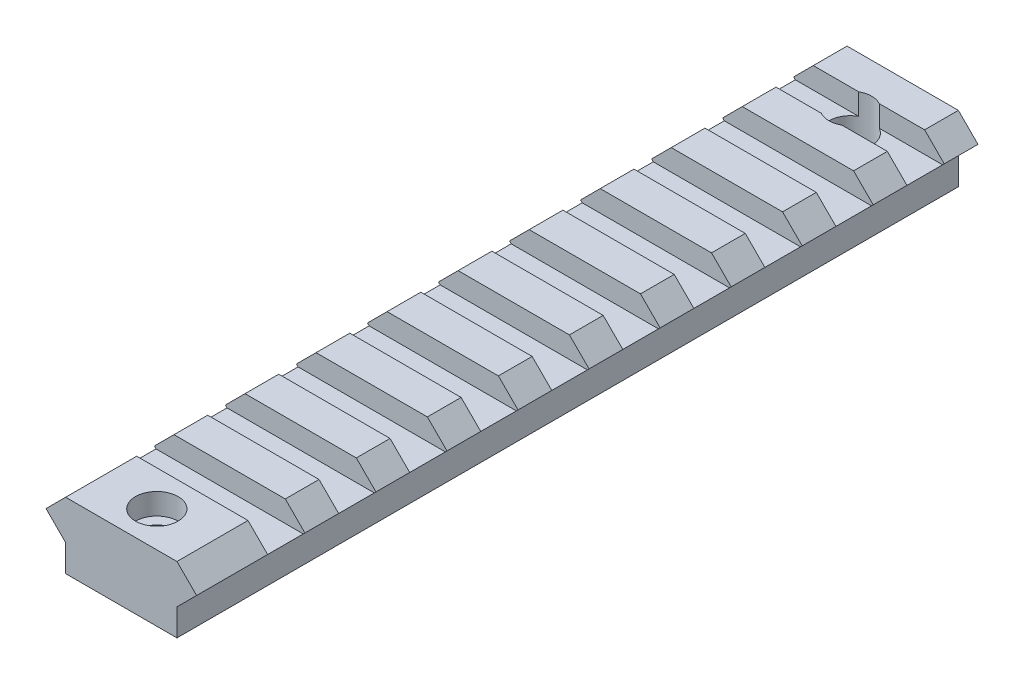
ISO-10303-21;
HEADER;
FILE_DESCRIPTION(('STEP AP214'),'2;1');
FILE_NAME('part.step','',(''),(''),'','','');
FILE_SCHEMA(('AUTOMOTIVE_DESIGN { 1 0 10303 214 1 1 1 1 }'));
ENDSEC;
DATA;
#1=APPLICATION_CONTEXT('core data for automotive mechanical design processes');
#2=APPLICATION_PROTOCOL_DEFINITION('international standard','automotive_design',2000,#1);
#3=PRODUCT_CONTEXT('',#1,'mechanical');
#4=PRODUCT('Part','Part','',(#3));
#5=PRODUCT_RELATED_PRODUCT_CATEGORY('part','',(#4));
#6=PRODUCT_DEFINITION_FORMATION('','',#4);
#7=PRODUCT_DEFINITION_CONTEXT('part definition',#1,'design');
#8=PRODUCT_DEFINITION('design','',#6,#7);
#9=PRODUCT_DEFINITION_SHAPE('','',#8);
#10=(LENGTH_UNIT() NAMED_UNIT(*) SI_UNIT(.MILLI.,.METRE.));
#11=(NAMED_UNIT(*) PLANE_ANGLE_UNIT() SI_UNIT($,.RADIAN.));
#12=(NAMED_UNIT(*) SI_UNIT($,.STERADIAN.) SOLID_ANGLE_UNIT());
#13=UNCERTAINTY_MEASURE_WITH_UNIT(LENGTH_MEASURE(1.E-05),#10,'distance_accuracy_value','');
#14=(GEOMETRIC_REPRESENTATION_CONTEXT(3) GLOBAL_UNCERTAINTY_ASSIGNED_CONTEXT((#13)) GLOBAL_UNIT_ASSIGNED_CONTEXT((#10,
#11,#12)) REPRESENTATION_CONTEXT('',''));
#15=CARTESIAN_POINT('',(0.,0.,0.));
#16=DIRECTION('',(0.,0.,1.));
#17=DIRECTION('',(1.,0.,0.));
#18=AXIS2_PLACEMENT_3D('',#15,#16,#17);
#19=CARTESIAN_POINT('',(0.,26.9695565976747,0.));
#20=DIRECTION('',(0.,1.,0.));
#21=DIRECTION('',(-1.,0.,0.));
#22=AXIS2_PLACEMENT_3D('',#19,#20,#21);
#23=PLANE('',#22);
#24=CARTESIAN_POINT('',(-18.1912438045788,26.9695565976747,7.375));
#25=DIRECTION('',(0.,1.,0.));
#26=DIRECTION('',(-1.,0.,0.));
#27=AXIS2_PLACEMENT_3D('',#24,#25,#26);
#28=CIRCLE('',#27,3.);
#29=CARTESIAN_POINT('',(-16.738875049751,26.9695565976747,10.));
#30=VERTEX_POINT('',#29);
#31=CARTESIAN_POINT('',(-16.738875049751,26.9695565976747,4.75));
#32=VERTEX_POINT('',#31);
#33=EDGE_CURVE('E536',#30,#32,#28,.T.);
#34=ORIENTED_EDGE('',*,*,#33,.F.);
#35=DIRECTION('',(1.,0.,0.));
#36=VECTOR('',#35,1.);
#37=CARTESIAN_POINT('',(-28.7912438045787,26.9695565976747,10.));
#38=LINE('',#37,#36);
#39=CARTESIAN_POINT('',(-7.82624380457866,26.9695565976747,10.));
#40=VERTEX_POINT('',#39);
#41=EDGE_CURVE('E566',#30,#40,#38,.T.);
#42=ORIENTED_EDGE('',*,*,#41,.T.);
#43=DIRECTION('',(0.,0.,1.));
#44=VECTOR('',#43,1.);
#45=CARTESIAN_POINT('',(-7.82624380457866,26.9695565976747,110.));
#46=LINE('',#45,#44);
#47=CARTESIAN_POINT('',(-7.82624380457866,26.9695565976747,4.75));
#48=VERTEX_POINT('',#47);
#49=EDGE_CURVE('E488',#48,#40,#46,.T.);
#50=ORIENTED_EDGE('',*,*,#49,.F.);
#51=DIRECTION('',(-1.,0.,0.));
#52=VECTOR('',#51,1.);
#53=CARTESIAN_POINT('',(-28.7912438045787,26.9695565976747,4.75));
#54=LINE('',#53,#52);
#55=EDGE_CURVE('E567',#48,#32,#54,.T.);
#56=ORIENTED_EDGE('',*,*,#55,.T.);
#57=EDGE_LOOP('',(#34,#42,#50,#56));
#58=FACE_BOUND('',#57,.T.);
#59=ADVANCED_FACE('F36',(#58),#23,.T.);
#60=CARTESIAN_POINT('',(-28.7912438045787,26.9695565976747,4.75));
#61=DIRECTION('',(0.,0.,-1.));
#62=DIRECTION('',(-1.,0.,0.));
#63=AXIS2_PLACEMENT_3D('',#60,#61,#62);
#64=PLANE('',#63);
#65=CARTESIAN_POINT('',(-19.6436125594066,26.9695565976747,4.75));
#66=VERTEX_POINT('',#65);
#67=CARTESIAN_POINT('',(-28.5562438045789,26.9695565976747,4.75));
#68=VERTEX_POINT('',#67);
#69=EDGE_CURVE('E565',#66,#68,#54,.T.);
#70=ORIENTED_EDGE('',*,*,#69,.F.);
#71=DIRECTION('',(0.,1.,0.));
#72=VECTOR('',#71,1.);
#73=CARTESIAN_POINT('',(-19.6436125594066,23.9695565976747,4.75));
#74=LINE('',#73,#72);
#75=CARTESIAN_POINT('',(-19.6436125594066,29.9695565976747,4.75));
#76=VERTEX_POINT('',#75);
#77=EDGE_CURVE('E534',#66,#76,#74,.T.);
#78=ORIENTED_EDGE('',*,*,#77,.T.);
#79=DIRECTION('',(-1.,0.,0.));
#80=VECTOR('',#79,1.);
#81=CARTESIAN_POINT('',(0.,29.9695565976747,4.75));
#82=LINE('',#81,#80);
#83=CARTESIAN_POINT('',(-26.0262438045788,29.9695565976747,4.75));
#84=VERTEX_POINT('',#83);
#85=EDGE_CURVE('E501',#76,#84,#82,.T.);
#86=ORIENTED_EDGE('',*,*,#85,.T.);
#87=DIRECTION('',(0.707106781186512,0.707106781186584,0.));
#88=VECTOR('',#87,1.);
#89=CARTESIAN_POINT('',(-27.9979002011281,27.9979002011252,4.75));
#90=LINE('',#89,#88);
#91=CARTESIAN_POINT('',(-28.7912438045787,27.2045565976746,4.75));
#92=VERTEX_POINT('',#91);
#93=EDGE_CURVE('E819',#92,#84,#90,.T.);
#94=ORIENTED_EDGE('',*,*,#93,.F.);
#95=DIRECTION('',(-0.707106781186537,0.707106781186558,0.));
#96=VECTOR('',#95,1.);
#97=CARTESIAN_POINT('',(-0.793343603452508,-0.793343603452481,4.75));
#98=LINE('',#97,#96);
#99=EDGE_CURVE('E816',#68,#92,#98,.T.);
#100=ORIENTED_EDGE('',*,*,#99,.F.);
#101=EDGE_LOOP('',(#70,#78,#86,#94,#100));
#102=FACE_BOUND('',#101,.T.);
#103=ADVANCED_FACE('F1116',(#102),#64,.F.);
#104=CARTESIAN_POINT('',(-28.7912438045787,26.9695565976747,10.));
#105=DIRECTION('',(0.,0.,1.));
#106=DIRECTION('',(1.,0.,0.));
#107=AXIS2_PLACEMENT_3D('',#104,#105,#106);
#108=PLANE('',#107);
#109=ORIENTED_EDGE('',*,*,#41,.F.);
#110=DIRECTION('',(0.,1.,0.));
#111=VECTOR('',#110,1.);
#112=CARTESIAN_POINT('',(-16.738875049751,23.9695565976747,10.));
#113=LINE('',#112,#111);
#114=CARTESIAN_POINT('',(-16.738875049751,29.9695565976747,10.));
#115=VERTEX_POINT('',#114);
#116=EDGE_CURVE('E11',#30,#115,#113,.T.);
#117=ORIENTED_EDGE('',*,*,#116,.T.);
#118=DIRECTION('',(1.,0.,0.));
#119=VECTOR('',#118,1.);
#120=CARTESIAN_POINT('',(0.,29.9695565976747,9.99999999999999));
#121=LINE('',#120,#119);
#122=CARTESIAN_POINT('',(-10.3562438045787,29.9695565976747,10.));
#123=VERTEX_POINT('',#122);
#124=EDGE_CURVE('E496',#115,#123,#121,.T.);
#125=ORIENTED_EDGE('',*,*,#124,.T.);
#126=DIRECTION('',(0.707106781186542,-0.707106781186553,0.));
#127=VECTOR('',#126,1.);
#128=CARTESIAN_POINT('',(9.80665639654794,9.80665639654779,9.99999999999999));
#129=LINE('',#128,#127);
#130=CARTESIAN_POINT('',(-7.59124380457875,27.2045565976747,10.));
#131=VERTEX_POINT('',#130);
#132=EDGE_CURVE('E803',#123,#131,#129,.T.);
#133=ORIENTED_EDGE('',*,*,#132,.T.);
#134=DIRECTION('',(-0.707106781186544,-0.707106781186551,0.));
#135=VECTOR('',#134,1.);
#136=CARTESIAN_POINT('',(-17.3979002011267,17.3979002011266,9.99999999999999));
#137=LINE('',#136,#135);
#138=EDGE_CURVE('E805',#131,#40,#137,.T.);
#139=ORIENTED_EDGE('',*,*,#138,.T.);
#140=EDGE_LOOP('',(#109,#117,#125,#133,#139));
#141=FACE_BOUND('',#140,.T.);
#142=ADVANCED_FACE('F1107',(#141),#108,.F.);
#143=CARTESIAN_POINT('',(-18.1912438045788,20.6495565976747,7.375));
#144=DIRECTION('',(0.,1.,0.));
#145=DIRECTION('',(-1.,0.,0.));
#146=AXIS2_PLACEMENT_3D('',#143,#144,#145);
#147=CYLINDRICAL_SURFACE('',#146,1.5);
#148=CARTESIAN_POINT('',(-18.1912438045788,20.6495565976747,7.375));
#149=DIRECTION('',(0.,1.,0.));
#150=DIRECTION('',(-1.,0.,0.));
#151=AXIS2_PLACEMENT_3D('',#148,#149,#150);
#152=CIRCLE('',#151,1.5);
#153=CARTESIAN_POINT('',(-19.6912438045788,20.6495565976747,7.375));
#154=VERTEX_POINT('',#153);
#155=EDGE_CURVE('E547',#154,#154,#152,.T.);
#156=ORIENTED_EDGE('',*,*,#155,.F.);
#157=EDGE_LOOP('',(#156));
#158=FACE_BOUND('',#157,.T.);
#159=CARTESIAN_POINT('',(-18.1912438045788,23.9695565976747,7.375));
#160=DIRECTION('',(0.,1.,0.));
#161=DIRECTION('',(-1.,0.,0.));
#162=AXIS2_PLACEMENT_3D('',#159,#160,#161);
#163=CIRCLE('',#162,1.5);
#164=CARTESIAN_POINT('',(-19.6912438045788,23.9695565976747,7.375));
#165=VERTEX_POINT('',#164);
#166=EDGE_CURVE('E530',#165,#165,#163,.F.);
#167=ORIENTED_EDGE('',*,*,#166,.F.);
#168=EDGE_LOOP('',(#167));
#169=FACE_BOUND('',#168,.T.);
#170=ADVANCED_FACE('F1136',(#158,#169),#147,.F.);
#171=CARTESIAN_POINT('',(-27.9979002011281,27.9979002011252,110.));
#172=DIRECTION('',(0.707106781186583,-0.707106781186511,0.));
#173=DIRECTION('',(0.707106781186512,0.707106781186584,0.));
#174=AXIS2_PLACEMENT_3D('',#171,#172,#173);
#175=PLANE('',#174);
#176=DIRECTION('',(0.,0.,-1.));
#177=VECTOR('',#176,1.);
#178=CARTESIAN_POINT('',(-28.7912438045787,27.2045565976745,110.));
#179=LINE('',#178,#177);
#180=CARTESIAN_POINT('',(-28.7912438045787,27.2045565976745,0.));
#181=VERTEX_POINT('',#180);
#182=EDGE_CURVE('E919',#92,#181,#179,.T.);
#183=ORIENTED_EDGE('',*,*,#182,.F.);
#184=ORIENTED_EDGE('',*,*,#93,.T.);
#185=DIRECTION('',(0.,0.,-1.));
#186=VECTOR('',#185,1.);
#187=CARTESIAN_POINT('',(-26.0262438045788,29.9695565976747,110.));
#188=LINE('',#187,#186);
#189=CARTESIAN_POINT('',(-26.0262438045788,29.9695565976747,0.));
#190=VERTEX_POINT('',#189);
#191=EDGE_CURVE('E874',#84,#190,#188,.T.);
#192=ORIENTED_EDGE('',*,*,#191,.T.);
#193=DIRECTION('',(-0.707106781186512,-0.707106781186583,0.));
#194=VECTOR('',#193,1.);
#195=CARTESIAN_POINT('',(-27.9979002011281,27.9979002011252,0.));
#196=LINE('',#195,#194);
#197=EDGE_CURVE('E851',#190,#181,#196,.T.);
#198=ORIENTED_EDGE('',*,*,#197,.T.);
#199=EDGE_LOOP('',(#183,#184,#192,#198));
#200=FACE_BOUND('',#199,.T.);
#201=ADVANCED_FACE('F977',(#200),#175,.F.);
#202=CARTESIAN_POINT('',(-26.0262438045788,29.9695565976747,14.75));
#203=VERTEX_POINT('',#202);
#204=CARTESIAN_POINT('',(-26.0262438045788,29.9695565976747,9.99999999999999));
#205=VERTEX_POINT('',#204);
#206=EDGE_CURVE('E967',#203,#205,#188,.T.);
#207=ORIENTED_EDGE('',*,*,#206,.T.);
#208=DIRECTION('',(-0.707106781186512,-0.707106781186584,0.));
#209=VECTOR('',#208,1.);
#210=CARTESIAN_POINT('',(-27.9979002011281,27.9979002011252,9.99999999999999));
#211=LINE('',#210,#209);
#212=CARTESIAN_POINT('',(-28.7912438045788,27.2045565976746,10.));
#213=VERTEX_POINT('',#212);
#214=EDGE_CURVE('E59',#205,#213,#211,.T.);
#215=ORIENTED_EDGE('',*,*,#214,.T.);
#216=CARTESIAN_POINT('',(-28.7912438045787,27.2045565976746,14.75));
#217=VERTEX_POINT('',#216);
#218=EDGE_CURVE('E969',#217,#213,#179,.T.);
#219=ORIENTED_EDGE('',*,*,#218,.F.);
#220=DIRECTION('',(0.707106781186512,0.707106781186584,0.));
#221=VECTOR('',#220,1.);
#222=CARTESIAN_POINT('',(-27.9979002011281,27.9979002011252,14.75));
#223=LINE('',#222,#221);
#224=EDGE_CURVE('E800',#217,#203,#223,.T.);
#225=ORIENTED_EDGE('',*,*,#224,.T.);
#226=EDGE_LOOP('',(#207,#215,#219,#225));
#227=FACE_BOUND('',#226,.T.);
#228=ADVANCED_FACE('F966',(#227),#175,.F.);
#229=CARTESIAN_POINT('',(-26.0262438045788,29.9695565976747,24.75));
#230=VERTEX_POINT('',#229);
#231=CARTESIAN_POINT('',(-26.0262438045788,29.9695565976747,20.));
#232=VERTEX_POINT('',#231);
#233=EDGE_CURVE('E970',#230,#232,#188,.T.);
#234=ORIENTED_EDGE('',*,*,#233,.T.);
#235=DIRECTION('',(-0.707106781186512,-0.707106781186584,0.));
#236=VECTOR('',#235,1.);
#237=CARTESIAN_POINT('',(-27.9979002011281,27.9979002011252,20.));
#238=LINE('',#237,#236);
#239=CARTESIAN_POINT('',(-28.7912438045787,27.2045565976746,20.));
#240=VERTEX_POINT('',#239);
#241=EDGE_CURVE('E790',#232,#240,#238,.T.);
#242=ORIENTED_EDGE('',*,*,#241,.T.);
#243=CARTESIAN_POINT('',(-28.7912438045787,27.2045565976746,24.75));
#244=VERTEX_POINT('',#243);
#245=EDGE_CURVE('E1018',#244,#240,#179,.T.);
#246=ORIENTED_EDGE('',*,*,#245,.F.);
#247=DIRECTION('',(0.707106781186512,0.707106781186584,0.));
#248=VECTOR('',#247,1.);
#249=CARTESIAN_POINT('',(-27.9979002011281,27.9979002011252,24.75));
#250=LINE('',#249,#248);
#251=EDGE_CURVE('E780',#244,#230,#250,.T.);
#252=ORIENTED_EDGE('',*,*,#251,.T.);
#253=EDGE_LOOP('',(#234,#242,#246,#252));
#254=FACE_BOUND('',#253,.T.);
#255=ADVANCED_FACE('F1335',(#254),#175,.F.);
#256=CARTESIAN_POINT('',(-26.0262438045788,29.9695565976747,34.75));
#257=VERTEX_POINT('',#256);
#258=CARTESIAN_POINT('',(-26.0262438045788,29.9695565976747,30.));
#259=VERTEX_POINT('',#258);
#260=EDGE_CURVE('E972',#257,#259,#188,.T.);
#261=ORIENTED_EDGE('',*,*,#260,.T.);
#262=DIRECTION('',(-0.707106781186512,-0.707106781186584,0.));
#263=VECTOR('',#262,1.);
#264=CARTESIAN_POINT('',(-27.9979002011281,27.9979002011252,30.));
#265=LINE('',#264,#263);
#266=CARTESIAN_POINT('',(-28.7912438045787,27.2045565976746,30.));
#267=VERTEX_POINT('',#266);
#268=EDGE_CURVE('E770',#259,#267,#265,.T.);
#269=ORIENTED_EDGE('',*,*,#268,.T.);
#270=CARTESIAN_POINT('',(-28.7912438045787,27.2045565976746,34.75));
#271=VERTEX_POINT('',#270);
#272=EDGE_CURVE('E1020',#271,#267,#179,.T.);
#273=ORIENTED_EDGE('',*,*,#272,.F.);
#274=DIRECTION('',(0.707106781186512,0.707106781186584,0.));
#275=VECTOR('',#274,1.);
#276=CARTESIAN_POINT('',(-27.9979002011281,27.9979002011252,34.75));
#277=LINE('',#276,#275);
#278=EDGE_CURVE('E760',#271,#257,#277,.T.);
#279=ORIENTED_EDGE('',*,*,#278,.T.);
#280=EDGE_LOOP('',(#261,#269,#273,#279));
#281=FACE_BOUND('',#280,.T.);
#282=ADVANCED_FACE('F1308',(#281),#175,.F.);
#283=CARTESIAN_POINT('',(-26.0262438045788,29.9695565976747,44.75));
#284=VERTEX_POINT('',#283);
#285=CARTESIAN_POINT('',(-26.0262438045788,29.9695565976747,40.));
#286=VERTEX_POINT('',#285);
#287=EDGE_CURVE('E1299',#284,#286,#188,.T.);
#288=ORIENTED_EDGE('',*,*,#287,.T.);
#289=DIRECTION('',(-0.707106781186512,-0.707106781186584,0.));
#290=VECTOR('',#289,1.);
#291=CARTESIAN_POINT('',(-27.9979002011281,27.9979002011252,40.));
#292=LINE('',#291,#290);
#293=CARTESIAN_POINT('',(-28.7912438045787,27.2045565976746,40.));
#294=VERTEX_POINT('',#293);
#295=EDGE_CURVE('E750',#286,#294,#292,.T.);
#296=ORIENTED_EDGE('',*,*,#295,.T.);
#297=CARTESIAN_POINT('',(-28.7912438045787,27.2045565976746,44.75));
#298=VERTEX_POINT('',#297);
#299=EDGE_CURVE('E1023',#298,#294,#179,.T.);
#300=ORIENTED_EDGE('',*,*,#299,.F.);
#301=DIRECTION('',(0.707106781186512,0.707106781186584,0.));
#302=VECTOR('',#301,1.);
#303=CARTESIAN_POINT('',(-27.9979002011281,27.9979002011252,44.75));
#304=LINE('',#303,#302);
#305=EDGE_CURVE('E740',#298,#284,#304,.T.);
#306=ORIENTED_EDGE('',*,*,#305,.T.);
#307=EDGE_LOOP('',(#288,#296,#300,#306));
#308=FACE_BOUND('',#307,.T.);
#309=ADVANCED_FACE('F1415',(#308),#175,.F.);
#310=CARTESIAN_POINT('',(-26.0262438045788,29.9695565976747,54.75));
#311=VERTEX_POINT('',#310);
#312=CARTESIAN_POINT('',(-26.0262438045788,29.9695565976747,50.));
#313=VERTEX_POINT('',#312);
#314=EDGE_CURVE('E1295',#311,#313,#188,.T.);
#315=ORIENTED_EDGE('',*,*,#314,.T.);
#316=DIRECTION('',(-0.707106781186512,-0.707106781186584,0.));
#317=VECTOR('',#316,1.);
#318=CARTESIAN_POINT('',(-27.9979002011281,27.9979002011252,50.));
#319=LINE('',#318,#317);
#320=CARTESIAN_POINT('',(-28.7912438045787,27.2045565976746,50.));
#321=VERTEX_POINT('',#320);
#322=EDGE_CURVE('E730',#313,#321,#319,.T.);
#323=ORIENTED_EDGE('',*,*,#322,.T.);
#324=CARTESIAN_POINT('',(-28.7912438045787,27.2045565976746,54.75));
#325=VERTEX_POINT('',#324);
#326=EDGE_CURVE('E1026',#325,#321,#179,.T.);
#327=ORIENTED_EDGE('',*,*,#326,.F.);
#328=DIRECTION('',(0.707106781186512,0.707106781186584,0.));
#329=VECTOR('',#328,1.);
#330=CARTESIAN_POINT('',(-27.9979002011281,27.9979002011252,54.75));
#331=LINE('',#330,#329);
#332=EDGE_CURVE('E720',#325,#311,#331,.T.);
#333=ORIENTED_EDGE('',*,*,#332,.T.);
#334=EDGE_LOOP('',(#315,#323,#327,#333));
#335=FACE_BOUND('',#334,.T.);
#336=ADVANCED_FACE('F1402',(#335),#175,.F.);
#337=CARTESIAN_POINT('',(-26.0262438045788,29.9695565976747,64.75));
#338=VERTEX_POINT('',#337);
#339=CARTESIAN_POINT('',(-26.0262438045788,29.9695565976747,60.));
#340=VERTEX_POINT('',#339);
#341=EDGE_CURVE('E1292',#338,#340,#188,.T.);
#342=ORIENTED_EDGE('',*,*,#341,.T.);
#343=DIRECTION('',(-0.707106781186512,-0.707106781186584,0.));
#344=VECTOR('',#343,1.);
#345=CARTESIAN_POINT('',(-27.9979002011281,27.9979002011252,60.));
#346=LINE('',#345,#344);
#347=CARTESIAN_POINT('',(-28.7912438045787,27.2045565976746,60.));
#348=VERTEX_POINT('',#347);
#349=EDGE_CURVE('E710',#340,#348,#346,.T.);
#350=ORIENTED_EDGE('',*,*,#349,.T.);
#351=CARTESIAN_POINT('',(-28.7912438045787,27.2045565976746,64.75));
#352=VERTEX_POINT('',#351);
#353=EDGE_CURVE('E1029',#352,#348,#179,.T.);
#354=ORIENTED_EDGE('',*,*,#353,.F.);
#355=DIRECTION('',(0.707106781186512,0.707106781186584,0.));
#356=VECTOR('',#355,1.);
#357=CARTESIAN_POINT('',(-27.9979002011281,27.9979002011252,64.75));
#358=LINE('',#357,#356);
#359=EDGE_CURVE('E700',#352,#338,#358,.T.);
#360=ORIENTED_EDGE('',*,*,#359,.T.);
#361=EDGE_LOOP('',(#342,#350,#354,#360));
#362=FACE_BOUND('',#361,.T.);
#363=ADVANCED_FACE('F1285',(#362),#175,.F.);
#364=CARTESIAN_POINT('',(-26.0262438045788,29.9695565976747,74.75));
#365=VERTEX_POINT('',#364);
#366=CARTESIAN_POINT('',(-26.0262438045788,29.9695565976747,70.));
#367=VERTEX_POINT('',#366);
#368=EDGE_CURVE('E1290',#365,#367,#188,.T.);
#369=ORIENTED_EDGE('',*,*,#368,.T.);
#370=DIRECTION('',(-0.707106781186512,-0.707106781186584,0.));
#371=VECTOR('',#370,1.);
#372=CARTESIAN_POINT('',(-27.997900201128,27.9979002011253,70.));
#373=LINE('',#372,#371);
#374=CARTESIAN_POINT('',(-28.7912438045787,27.2045565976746,70.));
#375=VERTEX_POINT('',#374);
#376=EDGE_CURVE('E690',#367,#375,#373,.T.);
#377=ORIENTED_EDGE('',*,*,#376,.T.);
#378=CARTESIAN_POINT('',(-28.7912438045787,27.2045565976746,74.75));
#379=VERTEX_POINT('',#378);
#380=EDGE_CURVE('E1032',#379,#375,#179,.T.);
#381=ORIENTED_EDGE('',*,*,#380,.F.);
#382=DIRECTION('',(0.707106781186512,0.707106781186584,0.));
#383=VECTOR('',#382,1.);
#384=CARTESIAN_POINT('',(-27.9979002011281,27.9979002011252,74.75));
#385=LINE('',#384,#383);
#386=EDGE_CURVE('E680',#379,#365,#385,.T.);
#387=ORIENTED_EDGE('',*,*,#386,.T.);
#388=EDGE_LOOP('',(#369,#377,#381,#387));
#389=FACE_BOUND('',#388,.T.);
#390=ADVANCED_FACE('F1280',(#389),#175,.F.);
#391=CARTESIAN_POINT('',(-26.0262438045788,29.9695565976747,84.75));
#392=VERTEX_POINT('',#391);
#393=CARTESIAN_POINT('',(-26.0262438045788,29.9695565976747,80.));
#394=VERTEX_POINT('',#393);
#395=EDGE_CURVE('E1289',#392,#394,#188,.T.);
#396=ORIENTED_EDGE('',*,*,#395,.T.);
#397=DIRECTION('',(-0.707106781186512,-0.707106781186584,0.));
#398=VECTOR('',#397,1.);
#399=CARTESIAN_POINT('',(-27.9979002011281,27.9979002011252,79.9999999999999));
#400=LINE('',#399,#398);
#401=CARTESIAN_POINT('',(-28.7912438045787,27.2045565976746,79.9999999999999));
#402=VERTEX_POINT('',#401);
#403=EDGE_CURVE('E670',#394,#402,#400,.T.);
#404=ORIENTED_EDGE('',*,*,#403,.T.);
#405=CARTESIAN_POINT('',(-28.7912438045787,27.2045565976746,84.75));
#406=VERTEX_POINT('',#405);
#407=EDGE_CURVE('E1035',#406,#402,#179,.T.);
#408=ORIENTED_EDGE('',*,*,#407,.F.);
#409=DIRECTION('',(0.707106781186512,0.707106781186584,0.));
#410=VECTOR('',#409,1.);
#411=CARTESIAN_POINT('',(-27.9979002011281,27.9979002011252,84.75));
#412=LINE('',#411,#410);
#413=EDGE_CURVE('E660',#406,#392,#412,.T.);
#414=ORIENTED_EDGE('',*,*,#413,.T.);
#415=EDGE_LOOP('',(#396,#404,#408,#414));
#416=FACE_BOUND('',#415,.T.);
#417=ADVANCED_FACE('F1275',(#416),#175,.F.);
#418=CARTESIAN_POINT('',(-26.0262438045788,29.9695565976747,94.7499999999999));
#419=VERTEX_POINT('',#418);
#420=CARTESIAN_POINT('',(-26.0262438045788,29.9695565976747,90.));
#421=VERTEX_POINT('',#420);
#422=EDGE_CURVE('E900',#419,#421,#188,.T.);
#423=ORIENTED_EDGE('',*,*,#422,.T.);
#424=DIRECTION('',(-0.707106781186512,-0.707106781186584,0.));
#425=VECTOR('',#424,1.);
#426=CARTESIAN_POINT('',(-27.9979002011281,27.9979002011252,89.9999999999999));
#427=LINE('',#426,#425);
#428=CARTESIAN_POINT('',(-28.7912438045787,27.2045565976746,89.9999999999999));
#429=VERTEX_POINT('',#428);
#430=EDGE_CURVE('E650',#421,#429,#427,.T.);
#431=ORIENTED_EDGE('',*,*,#430,.T.);
#432=CARTESIAN_POINT('',(-28.7912438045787,27.2045565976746,94.7499999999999));
#433=VERTEX_POINT('',#432);
#434=EDGE_CURVE('E924',#433,#429,#179,.T.);
#435=ORIENTED_EDGE('',*,*,#434,.F.);
#436=DIRECTION('',(0.707106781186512,0.707106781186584,0.));
#437=VECTOR('',#436,1.);
#438=CARTESIAN_POINT('',(-27.9979002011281,27.9979002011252,94.7499999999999));
#439=LINE('',#438,#437);
#440=EDGE_CURVE('E640',#433,#419,#439,.T.);
#441=ORIENTED_EDGE('',*,*,#440,.T.);
#442=EDGE_LOOP('',(#423,#431,#435,#441));
#443=FACE_BOUND('',#442,.T.);
#444=ADVANCED_FACE('F1043',(#443),#175,.F.);
#445=CARTESIAN_POINT('',(9.80665639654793,9.80665639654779,110.));
#446=DIRECTION('',(0.707106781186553,0.707106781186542,0.));
#447=DIRECTION('',(-0.707106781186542,0.707106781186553,0.));
#448=AXIS2_PLACEMENT_3D('',#445,#446,#447);
#449=PLANE('',#448);
#450=DIRECTION('',(-0.707106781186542,0.707106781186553,0.));
#451=VECTOR('',#450,1.);
#452=CARTESIAN_POINT('',(9.80665639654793,9.80665639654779,4.75));
#453=LINE('',#452,#451);
#454=CARTESIAN_POINT('',(-7.59124380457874,27.2045565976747,4.75));
#455=VERTEX_POINT('',#454);
#456=CARTESIAN_POINT('',(-10.3562438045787,29.9695565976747,4.75));
#457=VERTEX_POINT('',#456);
#458=EDGE_CURVE('E812',#455,#457,#453,.T.);
#459=ORIENTED_EDGE('',*,*,#458,.F.);
#460=DIRECTION('',(0.,0.,-1.));
#461=VECTOR('',#460,1.);
#462=CARTESIAN_POINT('',(-7.59124380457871,27.2045565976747,110.));
#463=LINE('',#462,#461);
#464=CARTESIAN_POINT('',(-7.59124380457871,27.2045565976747,0.));
#465=VERTEX_POINT('',#464);
#466=EDGE_CURVE('E904',#455,#465,#463,.T.);
#467=ORIENTED_EDGE('',*,*,#466,.T.);
#468=DIRECTION('',(0.707106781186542,-0.707106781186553,0.));
#469=VECTOR('',#468,1.);
#470=CARTESIAN_POINT('',(9.80665639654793,9.80665639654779,0.));
#471=LINE('',#470,#469);
#472=CARTESIAN_POINT('',(-10.3562438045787,29.9695565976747,0.));
#473=VERTEX_POINT('',#472);
#474=EDGE_CURVE('E891',#473,#465,#471,.T.);
#475=ORIENTED_EDGE('',*,*,#474,.F.);
#476=DIRECTION('',(0.,0.,-1.));
#477=VECTOR('',#476,1.);
#478=CARTESIAN_POINT('',(-10.3562438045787,29.9695565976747,110.));
#479=LINE('',#478,#477);
#480=EDGE_CURVE('E899',#457,#473,#479,.T.);
#481=ORIENTED_EDGE('',*,*,#480,.F.);
#482=EDGE_LOOP('',(#459,#467,#475,#481));
#483=FACE_BOUND('',#482,.T.);
#484=ADVANCED_FACE('F992',(#483),#449,.T.);
#485=ORIENTED_EDGE('',*,*,#132,.F.);
#486=CARTESIAN_POINT('',(-10.3562438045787,29.9695565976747,14.75));
#487=VERTEX_POINT('',#486);
#488=EDGE_CURVE('E991',#487,#123,#479,.T.);
#489=ORIENTED_EDGE('',*,*,#488,.F.);
#490=DIRECTION('',(-0.707106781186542,0.707106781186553,0.));
#491=VECTOR('',#490,1.);
#492=CARTESIAN_POINT('',(9.80665639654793,9.80665639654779,14.75));
#493=LINE('',#492,#491);
#494=CARTESIAN_POINT('',(-7.59124380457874,27.2045565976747,14.75));
#495=VERTEX_POINT('',#494);
#496=EDGE_CURVE('E793',#495,#487,#493,.T.);
#497=ORIENTED_EDGE('',*,*,#496,.F.);
#498=EDGE_CURVE('E1103',#495,#131,#463,.T.);
#499=ORIENTED_EDGE('',*,*,#498,.T.);
#500=EDGE_LOOP('',(#485,#489,#497,#499));
#501=FACE_BOUND('',#500,.T.);
#502=ADVANCED_FACE('F1100',(#501),#449,.T.);
#503=DIRECTION('',(0.707106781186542,-0.707106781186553,0.));
#504=VECTOR('',#503,1.);
#505=CARTESIAN_POINT('',(9.80665639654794,9.80665639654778,20.));
#506=LINE('',#505,#504);
#507=CARTESIAN_POINT('',(-10.3562438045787,29.9695565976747,20.));
#508=VERTEX_POINT('',#507);
#509=CARTESIAN_POINT('',(-7.59124380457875,27.2045565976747,20.));
#510=VERTEX_POINT('',#509);
#511=EDGE_CURVE('E783',#508,#510,#506,.T.);
#512=ORIENTED_EDGE('',*,*,#511,.F.);
#513=CARTESIAN_POINT('',(-10.3562438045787,29.9695565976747,24.75));
#514=VERTEX_POINT('',#513);
#515=EDGE_CURVE('E1089',#514,#508,#479,.T.);
#516=ORIENTED_EDGE('',*,*,#515,.F.);
#517=DIRECTION('',(-0.707106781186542,0.707106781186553,0.));
#518=VECTOR('',#517,1.);
#519=CARTESIAN_POINT('',(9.80665639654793,9.80665639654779,24.75));
#520=LINE('',#519,#518);
#521=CARTESIAN_POINT('',(-7.59124380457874,27.2045565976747,24.75));
#522=VERTEX_POINT('',#521);
#523=EDGE_CURVE('E773',#522,#514,#520,.T.);
#524=ORIENTED_EDGE('',*,*,#523,.F.);
#525=EDGE_CURVE('E1320',#522,#510,#463,.T.);
#526=ORIENTED_EDGE('',*,*,#525,.T.);
#527=EDGE_LOOP('',(#512,#516,#524,#526));
#528=FACE_BOUND('',#527,.T.);
#529=ADVANCED_FACE('F1327',(#528),#449,.T.);
#530=DIRECTION('',(0.707106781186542,-0.707106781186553,0.));
#531=VECTOR('',#530,1.);
#532=CARTESIAN_POINT('',(9.80665639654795,9.80665639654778,30.));
#533=LINE('',#532,#531);
#534=CARTESIAN_POINT('',(-10.3562438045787,29.9695565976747,30.));
#535=VERTEX_POINT('',#534);
#536=CARTESIAN_POINT('',(-7.59124380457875,27.2045565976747,30.));
#537=VERTEX_POINT('',#536);
#538=EDGE_CURVE('E763',#535,#537,#533,.T.);
#539=ORIENTED_EDGE('',*,*,#538,.F.);
#540=CARTESIAN_POINT('',(-10.3562438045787,29.9695565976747,34.75));
#541=VERTEX_POINT('',#540);
#542=EDGE_CURVE('E1083',#541,#535,#479,.T.);
#543=ORIENTED_EDGE('',*,*,#542,.F.);
#544=DIRECTION('',(-0.707106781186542,0.707106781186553,0.));
#545=VECTOR('',#544,1.);
#546=CARTESIAN_POINT('',(9.80665639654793,9.80665639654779,34.75));
#547=LINE('',#546,#545);
#548=CARTESIAN_POINT('',(-7.59124380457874,27.2045565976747,34.75));
#549=VERTEX_POINT('',#548);
#550=EDGE_CURVE('E753',#549,#541,#547,.T.);
#551=ORIENTED_EDGE('',*,*,#550,.F.);
#552=EDGE_CURVE('E1317',#549,#537,#463,.T.);
#553=ORIENTED_EDGE('',*,*,#552,.T.);
#554=EDGE_LOOP('',(#539,#543,#551,#553));
#555=FACE_BOUND('',#554,.T.);
#556=ADVANCED_FACE('F1314',(#555),#449,.T.);
#557=DIRECTION('',(0.707106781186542,-0.707106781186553,0.));
#558=VECTOR('',#557,1.);
#559=CARTESIAN_POINT('',(9.80665639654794,9.80665639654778,40.));
#560=LINE('',#559,#558);
#561=CARTESIAN_POINT('',(-10.3562438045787,29.9695565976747,40.));
#562=VERTEX_POINT('',#561);
#563=CARTESIAN_POINT('',(-7.59124380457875,27.2045565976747,40.));
#564=VERTEX_POINT('',#563);
#565=EDGE_CURVE('E743',#562,#564,#560,.T.);
#566=ORIENTED_EDGE('',*,*,#565,.F.);
#567=CARTESIAN_POINT('',(-10.3562438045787,29.9695565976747,44.75));
#568=VERTEX_POINT('',#567);
#569=EDGE_CURVE('E1077',#568,#562,#479,.T.);
#570=ORIENTED_EDGE('',*,*,#569,.F.);
#571=DIRECTION('',(-0.707106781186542,0.707106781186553,0.));
#572=VECTOR('',#571,1.);
#573=CARTESIAN_POINT('',(9.80665639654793,9.80665639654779,44.75));
#574=LINE('',#573,#572);
#575=CARTESIAN_POINT('',(-7.59124380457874,27.2045565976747,44.75));
#576=VERTEX_POINT('',#575);
#577=EDGE_CURVE('E733',#576,#568,#574,.T.);
#578=ORIENTED_EDGE('',*,*,#577,.F.);
#579=EDGE_CURVE('E1319',#576,#564,#463,.T.);
#580=ORIENTED_EDGE('',*,*,#579,.T.);
#581=EDGE_LOOP('',(#566,#570,#578,#580));
#582=FACE_BOUND('',#581,.T.);
#583=ADVANCED_FACE('F1419',(#582),#449,.T.);
#584=DIRECTION('',(0.707106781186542,-0.707106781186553,0.));
#585=VECTOR('',#584,1.);
#586=CARTESIAN_POINT('',(9.80665639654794,9.80665639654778,50.));
#587=LINE('',#586,#585);
#588=CARTESIAN_POINT('',(-10.3562438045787,29.9695565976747,50.));
#589=VERTEX_POINT('',#588);
#590=CARTESIAN_POINT('',(-7.59124380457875,27.2045565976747,50.));
#591=VERTEX_POINT('',#590);
#592=EDGE_CURVE('E723',#589,#591,#587,.T.);
#593=ORIENTED_EDGE('',*,*,#592,.F.);
#594=CARTESIAN_POINT('',(-10.3562438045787,29.9695565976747,54.75));
#595=VERTEX_POINT('',#594);
#596=EDGE_CURVE('E1071',#595,#589,#479,.T.);
#597=ORIENTED_EDGE('',*,*,#596,.F.);
#598=DIRECTION('',(-0.707106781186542,0.707106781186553,0.));
#599=VECTOR('',#598,1.);
#600=CARTESIAN_POINT('',(9.80665639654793,9.80665639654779,54.75));
#601=LINE('',#600,#599);
#602=CARTESIAN_POINT('',(-7.59124380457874,27.2045565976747,54.75));
#603=VERTEX_POINT('',#602);
#604=EDGE_CURVE('E713',#603,#595,#601,.T.);
#605=ORIENTED_EDGE('',*,*,#604,.F.);
#606=EDGE_CURVE('E1322',#603,#591,#463,.T.);
#607=ORIENTED_EDGE('',*,*,#606,.T.);
#608=EDGE_LOOP('',(#593,#597,#605,#607));
#609=FACE_BOUND('',#608,.T.);
#610=ADVANCED_FACE('F1407',(#609),#449,.T.);
#611=DIRECTION('',(0.707106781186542,-0.707106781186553,0.));
#612=VECTOR('',#611,1.);
#613=CARTESIAN_POINT('',(9.80665639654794,9.80665639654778,60.));
#614=LINE('',#613,#612);
#615=CARTESIAN_POINT('',(-10.3562438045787,29.9695565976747,60.));
#616=VERTEX_POINT('',#615);
#617=CARTESIAN_POINT('',(-7.59124380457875,27.2045565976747,60.));
#618=VERTEX_POINT('',#617);
#619=EDGE_CURVE('E703',#616,#618,#614,.T.);
#620=ORIENTED_EDGE('',*,*,#619,.F.);
#621=CARTESIAN_POINT('',(-10.3562438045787,29.9695565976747,64.75));
#622=VERTEX_POINT('',#621);
#623=EDGE_CURVE('E1065',#622,#616,#479,.T.);
#624=ORIENTED_EDGE('',*,*,#623,.F.);
#625=DIRECTION('',(-0.707106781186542,0.707106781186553,0.));
#626=VECTOR('',#625,1.);
#627=CARTESIAN_POINT('',(9.80665639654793,9.80665639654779,64.75));
#628=LINE('',#627,#626);
#629=CARTESIAN_POINT('',(-7.59124380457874,27.2045565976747,64.75));
#630=VERTEX_POINT('',#629);
#631=EDGE_CURVE('E693',#630,#622,#628,.T.);
#632=ORIENTED_EDGE('',*,*,#631,.F.);
#633=EDGE_CURVE('E1395',#630,#618,#463,.T.);
#634=ORIENTED_EDGE('',*,*,#633,.T.);
#635=EDGE_LOOP('',(#620,#624,#632,#634));
#636=FACE_BOUND('',#635,.T.);
#637=ADVANCED_FACE('F1393',(#636),#449,.T.);
#638=DIRECTION('',(0.707106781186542,-0.707106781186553,0.));
#639=VECTOR('',#638,1.);
#640=CARTESIAN_POINT('',(9.80665639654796,9.80665639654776,70.));
#641=LINE('',#640,#639);
#642=CARTESIAN_POINT('',(-10.3562438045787,29.9695565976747,70.));
#643=VERTEX_POINT('',#642);
#644=CARTESIAN_POINT('',(-7.59124380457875,27.2045565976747,70.));
#645=VERTEX_POINT('',#644);
#646=EDGE_CURVE('E683',#643,#645,#641,.T.);
#647=ORIENTED_EDGE('',*,*,#646,.F.);
#648=CARTESIAN_POINT('',(-10.3562438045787,29.9695565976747,74.75));
#649=VERTEX_POINT('',#648);
#650=EDGE_CURVE('E1059',#649,#643,#479,.T.);
#651=ORIENTED_EDGE('',*,*,#650,.F.);
#652=DIRECTION('',(-0.707106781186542,0.707106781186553,0.));
#653=VECTOR('',#652,1.);
#654=CARTESIAN_POINT('',(9.80665639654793,9.80665639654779,74.75));
#655=LINE('',#654,#653);
#656=CARTESIAN_POINT('',(-7.59124380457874,27.2045565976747,74.75));
#657=VERTEX_POINT('',#656);
#658=EDGE_CURVE('E673',#657,#649,#655,.T.);
#659=ORIENTED_EDGE('',*,*,#658,.F.);
#660=EDGE_CURVE('E1382',#657,#645,#463,.T.);
#661=ORIENTED_EDGE('',*,*,#660,.T.);
#662=EDGE_LOOP('',(#647,#651,#659,#661));
#663=FACE_BOUND('',#662,.T.);
#664=ADVANCED_FACE('F1356',(#663),#449,.T.);
#665=DIRECTION('',(0.707106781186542,-0.707106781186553,0.));
#666=VECTOR('',#665,1.);
#667=CARTESIAN_POINT('',(9.80665639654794,9.80665639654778,80.));
#668=LINE('',#667,#666);
#669=CARTESIAN_POINT('',(-10.3562438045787,29.9695565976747,80.));
#670=VERTEX_POINT('',#669);
#671=CARTESIAN_POINT('',(-7.59124380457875,27.2045565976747,80.));
#672=VERTEX_POINT('',#671);
#673=EDGE_CURVE('E663',#670,#672,#668,.T.);
#674=ORIENTED_EDGE('',*,*,#673,.F.);
#675=CARTESIAN_POINT('',(-10.3562438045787,29.9695565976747,84.75));
#676=VERTEX_POINT('',#675);
#677=EDGE_CURVE('E1057',#676,#670,#479,.T.);
#678=ORIENTED_EDGE('',*,*,#677,.F.);
#679=DIRECTION('',(-0.707106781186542,0.707106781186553,0.));
#680=VECTOR('',#679,1.);
#681=CARTESIAN_POINT('',(9.80665639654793,9.80665639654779,84.75));
#682=LINE('',#681,#680);
#683=CARTESIAN_POINT('',(-7.59124380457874,27.2045565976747,84.75));
#684=VERTEX_POINT('',#683);
#685=EDGE_CURVE('E653',#684,#676,#682,.T.);
#686=ORIENTED_EDGE('',*,*,#685,.F.);
#687=EDGE_CURVE('E1369',#684,#672,#463,.T.);
#688=ORIENTED_EDGE('',*,*,#687,.T.);
#689=EDGE_LOOP('',(#674,#678,#686,#688));
#690=FACE_BOUND('',#689,.T.);
#691=ADVANCED_FACE('F1352',(#690),#449,.T.);
#692=DIRECTION('',(0.707106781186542,-0.707106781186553,0.));
#693=VECTOR('',#692,1.);
#694=CARTESIAN_POINT('',(9.80665639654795,9.80665639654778,90.));
#695=LINE('',#694,#693);
#696=CARTESIAN_POINT('',(-10.3562438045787,29.9695565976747,90.));
#697=VERTEX_POINT('',#696);
#698=CARTESIAN_POINT('',(-7.59124380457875,27.2045565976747,90.));
#699=VERTEX_POINT('',#698);
#700=EDGE_CURVE('E643',#697,#699,#695,.T.);
#701=ORIENTED_EDGE('',*,*,#700,.F.);
#702=CARTESIAN_POINT('',(-10.3562438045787,29.9695565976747,94.7499999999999));
#703=VERTEX_POINT('',#702);
#704=EDGE_CURVE('E905',#703,#697,#479,.T.);
#705=ORIENTED_EDGE('',*,*,#704,.F.);
#706=DIRECTION('',(-0.707106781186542,0.707106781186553,0.));
#707=VECTOR('',#706,1.);
#708=CARTESIAN_POINT('',(9.80665639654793,9.80665639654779,94.7499999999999));
#709=LINE('',#708,#707);
#710=CARTESIAN_POINT('',(-7.59124380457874,27.2045565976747,94.7499999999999));
#711=VERTEX_POINT('',#710);
#712=EDGE_CURVE('E633',#711,#703,#709,.T.);
#713=ORIENTED_EDGE('',*,*,#712,.F.);
#714=EDGE_CURVE('E910',#711,#699,#463,.T.);
#715=ORIENTED_EDGE('',*,*,#714,.T.);
#716=EDGE_LOOP('',(#701,#705,#713,#715));
#717=FACE_BOUND('',#716,.T.);
#718=ADVANCED_FACE('F1255',(#717),#449,.T.);
#719=CARTESIAN_POINT('',(0.,29.9695565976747,110.));
#720=DIRECTION('',(0.,1.,0.));
#721=DIRECTION('',(-1.,0.,0.));
#722=AXIS2_PLACEMENT_3D('',#719,#720,#721);
#723=PLANE('',#722);
#724=CARTESIAN_POINT('',(-18.1912438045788,29.9695565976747,7.375));
#725=DIRECTION('',(0.,1.,0.));
#726=DIRECTION('',(-1.,0.,0.));
#727=AXIS2_PLACEMENT_3D('',#724,#725,#726);
#728=CIRCLE('',#727,3.);
#729=CARTESIAN_POINT('',(-16.738875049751,29.9695565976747,4.75));
#730=VERTEX_POINT('',#729);
#731=EDGE_CURVE('E498',#730,#76,#728,.T.);
#732=ORIENTED_EDGE('',*,*,#731,.F.);
#733=EDGE_CURVE('E503',#457,#730,#82,.T.);
#734=ORIENTED_EDGE('',*,*,#733,.F.);
#735=ORIENTED_EDGE('',*,*,#480,.T.);
#736=DIRECTION('',(1.,0.,0.));
#737=VECTOR('',#736,1.);
#738=CARTESIAN_POINT('',(0.,29.9695565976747,0.));
#739=LINE('',#738,#737);
#740=EDGE_CURVE('E856',#190,#473,#739,.T.);
#741=ORIENTED_EDGE('',*,*,#740,.F.);
#742=ORIENTED_EDGE('',*,*,#191,.F.);
#743=ORIENTED_EDGE('',*,*,#85,.F.);
#744=EDGE_LOOP('',(#732,#734,#735,#741,#742,#743));
#745=FACE_BOUND('',#744,.T.);
#746=ADVANCED_FACE('F985',(#745),#723,.T.);
#747=CARTESIAN_POINT('',(-19.6436125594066,29.9695565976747,10.));
#748=VERTEX_POINT('',#747);
#749=EDGE_CURVE('E485',#748,#115,#728,.T.);
#750=ORIENTED_EDGE('',*,*,#749,.F.);
#751=EDGE_CURVE('E493',#205,#748,#121,.T.);
#752=ORIENTED_EDGE('',*,*,#751,.F.);
#753=ORIENTED_EDGE('',*,*,#206,.F.);
#754=DIRECTION('',(-1.,0.,0.));
#755=VECTOR('',#754,1.);
#756=CARTESIAN_POINT('',(0.,29.9695565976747,14.75));
#757=LINE('',#756,#755);
#758=EDGE_CURVE('E505',#487,#203,#757,.T.);
#759=ORIENTED_EDGE('',*,*,#758,.F.);
#760=ORIENTED_EDGE('',*,*,#488,.T.);
#761=ORIENTED_EDGE('',*,*,#124,.F.);
#762=EDGE_LOOP('',(#750,#752,#753,#759,#760,#761));
#763=FACE_BOUND('',#762,.T.);
#764=ADVANCED_FACE('F491',(#763),#723,.T.);
#765=DIRECTION('',(1.,0.,0.));
#766=VECTOR('',#765,1.);
#767=CARTESIAN_POINT('',(0.,29.9695565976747,20.));
#768=LINE('',#767,#766);
#769=EDGE_CURVE('E955',#232,#508,#768,.T.);
#770=ORIENTED_EDGE('',*,*,#769,.F.);
#771=ORIENTED_EDGE('',*,*,#233,.F.);
#772=DIRECTION('',(-1.,0.,0.));
#773=VECTOR('',#772,1.);
#774=CARTESIAN_POINT('',(0.,29.9695565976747,24.75));
#775=LINE('',#774,#773);
#776=EDGE_CURVE('E954',#514,#230,#775,.T.);
#777=ORIENTED_EDGE('',*,*,#776,.F.);
#778=ORIENTED_EDGE('',*,*,#515,.T.);
#779=EDGE_LOOP('',(#770,#771,#777,#778));
#780=FACE_BOUND('',#779,.T.);
#781=ADVANCED_FACE('F1337',(#780),#723,.T.);
#782=DIRECTION('',(1.,0.,0.));
#783=VECTOR('',#782,1.);
#784=CARTESIAN_POINT('',(0.,29.9695565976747,30.));
#785=LINE('',#784,#783);
#786=EDGE_CURVE('E952',#259,#535,#785,.T.);
#787=ORIENTED_EDGE('',*,*,#786,.F.);
#788=ORIENTED_EDGE('',*,*,#260,.F.);
#789=DIRECTION('',(-1.,0.,0.));
#790=VECTOR('',#789,1.);
#791=CARTESIAN_POINT('',(0.,29.9695565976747,34.75));
#792=LINE('',#791,#790);
#793=EDGE_CURVE('E950',#541,#257,#792,.T.);
#794=ORIENTED_EDGE('',*,*,#793,.F.);
#795=ORIENTED_EDGE('',*,*,#542,.T.);
#796=EDGE_LOOP('',(#787,#788,#794,#795));
#797=FACE_BOUND('',#796,.T.);
#798=ADVANCED_FACE('F1309',(#797),#723,.T.);
#799=DIRECTION('',(1.,0.,0.));
#800=VECTOR('',#799,1.);
#801=CARTESIAN_POINT('',(0.,29.9695565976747,40.));
#802=LINE('',#801,#800);
#803=EDGE_CURVE('E948',#286,#562,#802,.T.);
#804=ORIENTED_EDGE('',*,*,#803,.F.);
#805=ORIENTED_EDGE('',*,*,#287,.F.);
#806=DIRECTION('',(-1.,0.,0.));
#807=VECTOR('',#806,1.);
#808=CARTESIAN_POINT('',(0.,29.9695565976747,44.75));
#809=LINE('',#808,#807);
#810=EDGE_CURVE('E946',#568,#284,#809,.T.);
#811=ORIENTED_EDGE('',*,*,#810,.F.);
#812=ORIENTED_EDGE('',*,*,#569,.T.);
#813=EDGE_LOOP('',(#804,#805,#811,#812));
#814=FACE_BOUND('',#813,.T.);
#815=ADVANCED_FACE('F1345',(#814),#723,.T.);
#816=DIRECTION('',(1.,0.,0.));
#817=VECTOR('',#816,1.);
#818=CARTESIAN_POINT('',(0.,29.9695565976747,50.));
#819=LINE('',#818,#817);
#820=EDGE_CURVE('E944',#313,#589,#819,.T.);
#821=ORIENTED_EDGE('',*,*,#820,.F.);
#822=ORIENTED_EDGE('',*,*,#314,.F.);
#823=DIRECTION('',(-1.,0.,0.));
#824=VECTOR('',#823,1.);
#825=CARTESIAN_POINT('',(0.,29.9695565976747,54.75));
#826=LINE('',#825,#824);
#827=EDGE_CURVE('E942',#595,#311,#826,.T.);
#828=ORIENTED_EDGE('',*,*,#827,.F.);
#829=ORIENTED_EDGE('',*,*,#596,.T.);
#830=EDGE_LOOP('',(#821,#822,#828,#829));
#831=FACE_BOUND('',#830,.T.);
#832=ADVANCED_FACE('F1405',(#831),#723,.T.);
#833=DIRECTION('',(1.,0.,0.));
#834=VECTOR('',#833,1.);
#835=CARTESIAN_POINT('',(0.,29.9695565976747,60.));
#836=LINE('',#835,#834);
#837=EDGE_CURVE('E940',#340,#616,#836,.T.);
#838=ORIENTED_EDGE('',*,*,#837,.F.);
#839=ORIENTED_EDGE('',*,*,#341,.F.);
#840=DIRECTION('',(-1.,0.,0.));
#841=VECTOR('',#840,1.);
#842=CARTESIAN_POINT('',(0.,29.9695565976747,64.75));
#843=LINE('',#842,#841);
#844=EDGE_CURVE('E938',#622,#338,#843,.T.);
#845=ORIENTED_EDGE('',*,*,#844,.F.);
#846=ORIENTED_EDGE('',*,*,#623,.T.);
#847=EDGE_LOOP('',(#838,#839,#845,#846));
#848=FACE_BOUND('',#847,.T.);
#849=ADVANCED_FACE('F1391',(#848),#723,.T.);
#850=DIRECTION('',(1.,0.,0.));
#851=VECTOR('',#850,1.);
#852=CARTESIAN_POINT('',(0.,29.9695565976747,70.));
#853=LINE('',#852,#851);
#854=EDGE_CURVE('E936',#367,#643,#853,.T.);
#855=ORIENTED_EDGE('',*,*,#854,.F.);
#856=ORIENTED_EDGE('',*,*,#368,.F.);
#857=DIRECTION('',(-1.,0.,0.));
#858=VECTOR('',#857,1.);
#859=CARTESIAN_POINT('',(0.,29.9695565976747,74.75));
#860=LINE('',#859,#858);
#861=EDGE_CURVE('E934',#649,#365,#860,.T.);
#862=ORIENTED_EDGE('',*,*,#861,.F.);
#863=ORIENTED_EDGE('',*,*,#650,.T.);
#864=EDGE_LOOP('',(#855,#856,#862,#863));
#865=FACE_BOUND('',#864,.T.);
#866=ADVANCED_FACE('F1379',(#865),#723,.T.);
#867=DIRECTION('',(1.,0.,0.));
#868=VECTOR('',#867,1.);
#869=CARTESIAN_POINT('',(0.,29.9695565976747,80.));
#870=LINE('',#869,#868);
#871=EDGE_CURVE('E932',#394,#670,#870,.T.);
#872=ORIENTED_EDGE('',*,*,#871,.F.);
#873=ORIENTED_EDGE('',*,*,#395,.F.);
#874=DIRECTION('',(-1.,0.,0.));
#875=VECTOR('',#874,1.);
#876=CARTESIAN_POINT('',(0.,29.9695565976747,84.75));
#877=LINE('',#876,#875);
#878=EDGE_CURVE('E930',#676,#392,#877,.T.);
#879=ORIENTED_EDGE('',*,*,#878,.F.);
#880=ORIENTED_EDGE('',*,*,#677,.T.);
#881=EDGE_LOOP('',(#872,#873,#879,#880));
#882=FACE_BOUND('',#881,.T.);
#883=ADVANCED_FACE('F1272',(#882),#723,.T.);
#884=DIRECTION('',(1.,0.,0.));
#885=VECTOR('',#884,1.);
#886=CARTESIAN_POINT('',(0.,29.9695565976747,90.));
#887=LINE('',#886,#885);
#888=EDGE_CURVE('E928',#421,#697,#887,.T.);
#889=ORIENTED_EDGE('',*,*,#888,.F.);
#890=ORIENTED_EDGE('',*,*,#422,.F.);
#891=DIRECTION('',(-1.,0.,0.));
#892=VECTOR('',#891,1.);
#893=CARTESIAN_POINT('',(0.,29.9695565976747,94.7499999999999));
#894=LINE('',#893,#892);
#895=EDGE_CURVE('E926',#703,#419,#894,.T.);
#896=ORIENTED_EDGE('',*,*,#895,.F.);
#897=ORIENTED_EDGE('',*,*,#704,.T.);
#898=EDGE_LOOP('',(#889,#890,#896,#897));
#899=FACE_BOUND('',#898,.T.);
#900=ADVANCED_FACE('F1052',(#899),#723,.T.);
#901=CARTESIAN_POINT('',(-26.0262438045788,29.9695565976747,110.));
#902=VERTEX_POINT('',#901);
#903=CARTESIAN_POINT('',(-26.0262438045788,29.9695565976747,99.9999999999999));
#904=VERTEX_POINT('',#903);
#905=EDGE_CURVE('E896',#902,#904,#188,.T.);
#906=ORIENTED_EDGE('',*,*,#905,.T.);
#907=DIRECTION('',(-0.707106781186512,-0.707106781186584,0.));
#908=VECTOR('',#907,1.);
#909=CARTESIAN_POINT('',(-27.9979002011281,27.9979002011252,99.9999999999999));
#910=LINE('',#909,#908);
#911=CARTESIAN_POINT('',(-28.7912438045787,27.2045565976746,99.9999999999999));
#912=VERTEX_POINT('',#911);
#913=EDGE_CURVE('E630',#904,#912,#910,.T.);
#914=ORIENTED_EDGE('',*,*,#913,.T.);
#915=CARTESIAN_POINT('',(-28.7912438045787,27.2045565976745,110.));
#916=VERTEX_POINT('',#915);
#917=EDGE_CURVE('E920',#916,#912,#179,.T.);
#918=ORIENTED_EDGE('',*,*,#917,.F.);
#919=DIRECTION('',(-0.707106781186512,-0.707106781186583,0.));
#920=VECTOR('',#919,1.);
#921=CARTESIAN_POINT('',(-27.9979002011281,27.9979002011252,110.));
#922=LINE('',#921,#920);
#923=EDGE_CURVE('E852',#902,#916,#922,.T.);
#924=ORIENTED_EDGE('',*,*,#923,.F.);
#925=EDGE_LOOP('',(#906,#914,#918,#924));
#926=FACE_BOUND('',#925,.T.);
#927=ADVANCED_FACE('F38',(#926),#175,.F.);
#928=CARTESIAN_POINT('',(-0.793343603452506,-0.793343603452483,110.));
#929=DIRECTION('',(0.707106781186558,0.707106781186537,0.));
#930=DIRECTION('',(-0.707106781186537,0.707106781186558,0.));
#931=AXIS2_PLACEMENT_3D('',#928,#929,#930);
#932=PLANE('',#931);
#933=DIRECTION('',(0.,0.,1.));
#934=VECTOR('',#933,1.);
#935=CARTESIAN_POINT('',(-28.5562438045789,26.9695565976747,110.));
#936=LINE('',#935,#934);
#937=CARTESIAN_POINT('',(-28.5562438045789,26.9695565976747,10.));
#938=VERTEX_POINT('',#937);
#939=EDGE_CURVE('E849',#68,#938,#936,.T.);
#940=ORIENTED_EDGE('',*,*,#939,.F.);
#941=ORIENTED_EDGE('',*,*,#99,.T.);
#942=ORIENTED_EDGE('',*,*,#182,.T.);
#943=DIRECTION('',(0.707106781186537,-0.707106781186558,0.));
#944=VECTOR('',#943,1.);
#945=CARTESIAN_POINT('',(-0.793343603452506,-0.793343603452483,0.));
#946=LINE('',#945,#944);
#947=CARTESIAN_POINT('',(-26.0262438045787,24.4395565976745,0.));
#948=VERTEX_POINT('',#947);
#949=EDGE_CURVE('E877',#181,#948,#946,.T.);
#950=ORIENTED_EDGE('',*,*,#949,.T.);
#951=DIRECTION('',(0.,0.,-1.));
#952=VECTOR('',#951,1.);
#953=CARTESIAN_POINT('',(-26.0262438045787,24.4395565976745,110.));
#954=LINE('',#953,#952);
#955=CARTESIAN_POINT('',(-26.0262438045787,24.4395565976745,110.));
#956=VERTEX_POINT('',#955);
#957=EDGE_CURVE('E917',#956,#948,#954,.T.);
#958=ORIENTED_EDGE('',*,*,#957,.F.);
#959=DIRECTION('',(0.707106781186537,-0.707106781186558,0.));
#960=VECTOR('',#959,1.);
#961=CARTESIAN_POINT('',(-0.793343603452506,-0.793343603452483,110.));
#962=LINE('',#961,#960);
#963=EDGE_CURVE('E855',#916,#956,#962,.T.);
#964=ORIENTED_EDGE('',*,*,#963,.F.);
#965=ORIENTED_EDGE('',*,*,#917,.T.);
#966=DIRECTION('',(0.707106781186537,-0.707106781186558,0.));
#967=VECTOR('',#966,1.);
#968=CARTESIAN_POINT('',(-0.793343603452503,-0.793343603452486,99.9999999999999));
#969=LINE('',#968,#967);
#970=CARTESIAN_POINT('',(-28.5562438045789,26.9695565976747,99.9999999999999));
#971=VERTEX_POINT('',#970);
#972=EDGE_CURVE('E627',#912,#971,#969,.T.);
#973=ORIENTED_EDGE('',*,*,#972,.T.);
#974=DIRECTION('',(0.,0.,-1.));
#975=VECTOR('',#974,1.);
#976=CARTESIAN_POINT('',(-28.5562438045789,26.9695565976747,110.));
#977=LINE('',#976,#975);
#978=CARTESIAN_POINT('',(-28.5562438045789,26.9695565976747,94.7499999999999));
#979=VERTEX_POINT('',#978);
#980=EDGE_CURVE('E822',#971,#979,#977,.T.);
#981=ORIENTED_EDGE('',*,*,#980,.T.);
#982=DIRECTION('',(-0.707106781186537,0.707106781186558,0.));
#983=VECTOR('',#982,1.);
#984=CARTESIAN_POINT('',(-0.793343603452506,-0.793343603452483,94.7499999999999));
#985=LINE('',#984,#983);
#986=EDGE_CURVE('E637',#979,#433,#985,.T.);
#987=ORIENTED_EDGE('',*,*,#986,.T.);
#988=ORIENTED_EDGE('',*,*,#434,.T.);
#989=DIRECTION('',(0.707106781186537,-0.707106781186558,0.));
#990=VECTOR('',#989,1.);
#991=CARTESIAN_POINT('',(-0.793343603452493,-0.793343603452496,90.));
#992=LINE('',#991,#990);
#993=CARTESIAN_POINT('',(-28.5562438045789,26.9695565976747,89.9999999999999));
#994=VERTEX_POINT('',#993);
#995=EDGE_CURVE('E647',#429,#994,#992,.T.);
#996=ORIENTED_EDGE('',*,*,#995,.T.);
#997=DIRECTION('',(0.,0.,-1.));
#998=VECTOR('',#997,1.);
#999=CARTESIAN_POINT('',(-28.5562438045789,26.9695565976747,110.));
#1000=LINE('',#999,#998);
#1001=CARTESIAN_POINT('',(-28.5562438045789,26.9695565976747,84.75));
#1002=VERTEX_POINT('',#1001);
#1003=EDGE_CURVE('E825',#994,#1002,#1000,.T.);
#1004=ORIENTED_EDGE('',*,*,#1003,.T.);
#1005=DIRECTION('',(-0.707106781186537,0.707106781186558,0.));
#1006=VECTOR('',#1005,1.);
#1007=CARTESIAN_POINT('',(-0.793343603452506,-0.793343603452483,84.75));
#1008=LINE('',#1007,#1006);
#1009=EDGE_CURVE('E657',#1002,#406,#1008,.T.);
#1010=ORIENTED_EDGE('',*,*,#1009,.T.);
#1011=ORIENTED_EDGE('',*,*,#407,.T.);
#1012=DIRECTION('',(0.707106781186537,-0.707106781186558,0.));
#1013=VECTOR('',#1012,1.);
#1014=CARTESIAN_POINT('',(-0.793343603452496,-0.793343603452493,80.));
#1015=LINE('',#1014,#1013);
#1016=CARTESIAN_POINT('',(-28.5562438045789,26.9695565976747,79.9999999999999));
#1017=VERTEX_POINT('',#1016);
#1018=EDGE_CURVE('E667',#402,#1017,#1015,.T.);
#1019=ORIENTED_EDGE('',*,*,#1018,.T.);
#1020=DIRECTION('',(0.,0.,-1.));
#1021=VECTOR('',#1020,1.);
#1022=CARTESIAN_POINT('',(-28.5562438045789,26.9695565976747,110.));
#1023=LINE('',#1022,#1021);
#1024=CARTESIAN_POINT('',(-28.5562438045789,26.9695565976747,74.75));
#1025=VERTEX_POINT('',#1024);
#1026=EDGE_CURVE('E828',#1017,#1025,#1023,.T.);
#1027=ORIENTED_EDGE('',*,*,#1026,.T.);
#1028=DIRECTION('',(-0.707106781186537,0.707106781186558,0.));
#1029=VECTOR('',#1028,1.);
#1030=CARTESIAN_POINT('',(-0.793343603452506,-0.793343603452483,74.75));
#1031=LINE('',#1030,#1029);
#1032=EDGE_CURVE('E677',#1025,#379,#1031,.T.);
#1033=ORIENTED_EDGE('',*,*,#1032,.T.);
#1034=ORIENTED_EDGE('',*,*,#380,.T.);
#1035=DIRECTION('',(0.707106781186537,-0.707106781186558,0.));
#1036=VECTOR('',#1035,1.);
#1037=CARTESIAN_POINT('',(-0.79334360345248,-0.793343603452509,70.));
#1038=LINE('',#1037,#1036);
#1039=CARTESIAN_POINT('',(-28.5562438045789,26.9695565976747,70.));
#1040=VERTEX_POINT('',#1039);
#1041=EDGE_CURVE('E687',#375,#1040,#1038,.T.);
#1042=ORIENTED_EDGE('',*,*,#1041,.T.);
#1043=DIRECTION('',(0.,0.,-1.));
#1044=VECTOR('',#1043,1.);
#1045=CARTESIAN_POINT('',(-28.5562438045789,26.9695565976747,110.));
#1046=LINE('',#1045,#1044);
#1047=CARTESIAN_POINT('',(-28.5562438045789,26.9695565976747,64.75));
#1048=VERTEX_POINT('',#1047);
#1049=EDGE_CURVE('E831',#1040,#1048,#1046,.T.);
#1050=ORIENTED_EDGE('',*,*,#1049,.T.);
#1051=DIRECTION('',(-0.707106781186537,0.707106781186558,0.));
#1052=VECTOR('',#1051,1.);
#1053=CARTESIAN_POINT('',(-0.793343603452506,-0.793343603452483,64.75));
#1054=LINE('',#1053,#1052);
#1055=EDGE_CURVE('E697',#1048,#352,#1054,.T.);
#1056=ORIENTED_EDGE('',*,*,#1055,.T.);
#1057=ORIENTED_EDGE('',*,*,#353,.T.);
#1058=DIRECTION('',(0.707106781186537,-0.707106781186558,0.));
#1059=VECTOR('',#1058,1.);
#1060=CARTESIAN_POINT('',(-0.793343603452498,-0.793343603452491,60.));
#1061=LINE('',#1060,#1059);
#1062=CARTESIAN_POINT('',(-28.5562438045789,26.9695565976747,60.));
#1063=VERTEX_POINT('',#1062);
#1064=EDGE_CURVE('E707',#348,#1063,#1061,.T.);
#1065=ORIENTED_EDGE('',*,*,#1064,.T.);
#1066=DIRECTION('',(0.,0.,-1.));
#1067=VECTOR('',#1066,1.);
#1068=CARTESIAN_POINT('',(-28.5562438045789,26.9695565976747,110.));
#1069=LINE('',#1068,#1067);
#1070=CARTESIAN_POINT('',(-28.5562438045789,26.9695565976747,54.75));
#1071=VERTEX_POINT('',#1070);
#1072=EDGE_CURVE('E834',#1063,#1071,#1069,.T.);
#1073=ORIENTED_EDGE('',*,*,#1072,.T.);
#1074=DIRECTION('',(-0.707106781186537,0.707106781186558,0.));
#1075=VECTOR('',#1074,1.);
#1076=CARTESIAN_POINT('',(-0.793343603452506,-0.793343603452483,54.75));
#1077=LINE('',#1076,#1075);
#1078=EDGE_CURVE('E717',#1071,#325,#1077,.T.);
#1079=ORIENTED_EDGE('',*,*,#1078,.T.);
#1080=ORIENTED_EDGE('',*,*,#326,.T.);
#1081=DIRECTION('',(0.707106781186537,-0.707106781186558,0.));
#1082=VECTOR('',#1081,1.);
#1083=CARTESIAN_POINT('',(-0.793343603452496,-0.793343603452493,50.));
#1084=LINE('',#1083,#1082);
#1085=CARTESIAN_POINT('',(-28.5562438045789,26.9695565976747,50.));
#1086=VERTEX_POINT('',#1085);
#1087=EDGE_CURVE('E727',#321,#1086,#1084,.T.);
#1088=ORIENTED_EDGE('',*,*,#1087,.T.);
#1089=DIRECTION('',(0.,0.,-1.));
#1090=VECTOR('',#1089,1.);
#1091=CARTESIAN_POINT('',(-28.5562438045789,26.9695565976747,110.));
#1092=LINE('',#1091,#1090);
#1093=CARTESIAN_POINT('',(-28.5562438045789,26.9695565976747,44.75));
#1094=VERTEX_POINT('',#1093);
#1095=EDGE_CURVE('E837',#1086,#1094,#1092,.T.);
#1096=ORIENTED_EDGE('',*,*,#1095,.T.);
#1097=DIRECTION('',(-0.707106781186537,0.707106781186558,0.));
#1098=VECTOR('',#1097,1.);
#1099=CARTESIAN_POINT('',(-0.793343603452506,-0.793343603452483,44.75));
#1100=LINE('',#1099,#1098);
#1101=EDGE_CURVE('E737',#1094,#298,#1100,.T.);
#1102=ORIENTED_EDGE('',*,*,#1101,.T.);
#1103=ORIENTED_EDGE('',*,*,#299,.T.);
#1104=DIRECTION('',(0.707106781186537,-0.707106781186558,0.));
#1105=VECTOR('',#1104,1.);
#1106=CARTESIAN_POINT('',(-0.793343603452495,-0.793343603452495,40.));
#1107=LINE('',#1106,#1105);
#1108=CARTESIAN_POINT('',(-28.5562438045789,26.9695565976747,40.));
#1109=VERTEX_POINT('',#1108);
#1110=EDGE_CURVE('E747',#294,#1109,#1107,.T.);
#1111=ORIENTED_EDGE('',*,*,#1110,.T.);
#1112=DIRECTION('',(0.,0.,-1.));
#1113=VECTOR('',#1112,1.);
#1114=CARTESIAN_POINT('',(-28.5562438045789,26.9695565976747,110.));
#1115=LINE('',#1114,#1113);
#1116=CARTESIAN_POINT('',(-28.5562438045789,26.9695565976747,34.75));
#1117=VERTEX_POINT('',#1116);
#1118=EDGE_CURVE('E840',#1109,#1117,#1115,.T.);
#1119=ORIENTED_EDGE('',*,*,#1118,.T.);
#1120=DIRECTION('',(-0.707106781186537,0.707106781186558,0.));
#1121=VECTOR('',#1120,1.);
#1122=CARTESIAN_POINT('',(-0.793343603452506,-0.793343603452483,34.75));
#1123=LINE('',#1122,#1121);
#1124=EDGE_CURVE('E757',#1117,#271,#1123,.T.);
#1125=ORIENTED_EDGE('',*,*,#1124,.T.);
#1126=ORIENTED_EDGE('',*,*,#272,.T.);
#1127=DIRECTION('',(0.707106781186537,-0.707106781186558,0.));
#1128=VECTOR('',#1127,1.);
#1129=CARTESIAN_POINT('',(-0.793343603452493,-0.793343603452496,30.));
#1130=LINE('',#1129,#1128);
#1131=CARTESIAN_POINT('',(-28.5562438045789,26.9695565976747,30.));
#1132=VERTEX_POINT('',#1131);
#1133=EDGE_CURVE('E767',#267,#1132,#1130,.T.);
#1134=ORIENTED_EDGE('',*,*,#1133,.T.);
#1135=DIRECTION('',(0.,0.,-1.));
#1136=VECTOR('',#1135,1.);
#1137=CARTESIAN_POINT('',(-28.5562438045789,26.9695565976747,110.));
#1138=LINE('',#1137,#1136);
#1139=CARTESIAN_POINT('',(-28.5562438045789,26.9695565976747,24.75));
#1140=VERTEX_POINT('',#1139);
#1141=EDGE_CURVE('E843',#1132,#1140,#1138,.T.);
#1142=ORIENTED_EDGE('',*,*,#1141,.T.);
#1143=DIRECTION('',(-0.707106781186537,0.707106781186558,0.));
#1144=VECTOR('',#1143,1.);
#1145=CARTESIAN_POINT('',(-0.793343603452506,-0.793343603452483,24.75));
#1146=LINE('',#1145,#1144);
#1147=EDGE_CURVE('E777',#1140,#244,#1146,.T.);
#1148=ORIENTED_EDGE('',*,*,#1147,.T.);
#1149=ORIENTED_EDGE('',*,*,#245,.T.);
#1150=DIRECTION('',(0.707106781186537,-0.707106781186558,0.));
#1151=VECTOR('',#1150,1.);
#1152=CARTESIAN_POINT('',(-0.793343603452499,-0.793343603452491,20.));
#1153=LINE('',#1152,#1151);
#1154=CARTESIAN_POINT('',(-28.5562438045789,26.9695565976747,20.));
#1155=VERTEX_POINT('',#1154);
#1156=EDGE_CURVE('E787',#240,#1155,#1153,.T.);
#1157=ORIENTED_EDGE('',*,*,#1156,.T.);
#1158=DIRECTION('',(0.,0.,-1.));
#1159=VECTOR('',#1158,1.);
#1160=CARTESIAN_POINT('',(-28.5562438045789,26.9695565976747,110.));
#1161=LINE('',#1160,#1159);
#1162=CARTESIAN_POINT('',(-28.5562438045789,26.9695565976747,14.75));
#1163=VERTEX_POINT('',#1162);
#1164=EDGE_CURVE('E846',#1155,#1163,#1161,.T.);
#1165=ORIENTED_EDGE('',*,*,#1164,.T.);
#1166=DIRECTION('',(-0.707106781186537,0.707106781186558,0.));
#1167=VECTOR('',#1166,1.);
#1168=CARTESIAN_POINT('',(-0.793343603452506,-0.793343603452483,14.75));
#1169=LINE('',#1168,#1167);
#1170=EDGE_CURVE('E797',#1163,#217,#1169,.T.);
#1171=ORIENTED_EDGE('',*,*,#1170,.T.);
#1172=ORIENTED_EDGE('',*,*,#218,.T.);
#1173=DIRECTION('',(0.707106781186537,-0.707106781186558,0.));
#1174=VECTOR('',#1173,1.);
#1175=CARTESIAN_POINT('',(-0.793343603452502,-0.793343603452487,9.99999999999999));
#1176=LINE('',#1175,#1174);
#1177=EDGE_CURVE('E808',#213,#938,#1176,.T.);
#1178=ORIENTED_EDGE('',*,*,#1177,.T.);
#1179=EDGE_LOOP('',(#940,#941,#942,#950,#958,#964,#965,#973,#981,#987,#988,#996,#1004,#1010,
#1011,#1019,#1027,#1033,#1034,#1042,#1050,#1056,#1057,#1065,#1073,#1079,#1080,#1088,#1096,#1102,
#1103,#1111,#1119,#1125,#1126,#1134,#1142,#1148,#1149,#1157,#1165,#1171,#1172,#1178));
#1180=FACE_BOUND('',#1179,.T.);
#1181=ADVANCED_FACE('F1016',(#1180),#932,.F.);
#1182=CARTESIAN_POINT('',(-26.0262438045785,-2.13146651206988E-13,110.));
#1183=DIRECTION('',(-1.,0.,0.));
#1184=DIRECTION('',(0.,-1.,0.));
#1185=AXIS2_PLACEMENT_3D('',#1182,#1183,#1184);
#1186=PLANE('',#1185);
#1187=DIRECTION('',(0.,1.,0.));
#1188=VECTOR('',#1187,1.);
#1189=CARTESIAN_POINT('',(-26.0262438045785,-2.13146651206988E-13,0.));
#1190=LINE('',#1189,#1188);
#1191=CARTESIAN_POINT('',(-26.0262438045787,20.6495565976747,0.));
#1192=VERTEX_POINT('',#1191);
#1193=EDGE_CURVE('E880',#1192,#948,#1190,.T.);
#1194=ORIENTED_EDGE('',*,*,#1193,.F.);
#1195=DIRECTION('',(0.,0.,-1.));
#1196=VECTOR('',#1195,1.);
#1197=CARTESIAN_POINT('',(-26.0262438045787,20.6495565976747,110.));
#1198=LINE('',#1197,#1196);
#1199=CARTESIAN_POINT('',(-26.0262438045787,20.6495565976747,110.));
#1200=VERTEX_POINT('',#1199);
#1201=EDGE_CURVE('E915',#1200,#1192,#1198,.T.);
#1202=ORIENTED_EDGE('',*,*,#1201,.F.);
#1203=DIRECTION('',(0.,1.,0.));
#1204=VECTOR('',#1203,1.);
#1205=CARTESIAN_POINT('',(-26.0262438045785,-2.13146651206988E-13,110.));
#1206=LINE('',#1205,#1204);
#1207=EDGE_CURVE('E858',#1200,#956,#1206,.T.);
#1208=ORIENTED_EDGE('',*,*,#1207,.T.);
#1209=ORIENTED_EDGE('',*,*,#957,.T.);
#1210=EDGE_LOOP('',(#1194,#1202,#1208,#1209));
#1211=FACE_BOUND('',#1210,.T.);
#1212=ADVANCED_FACE('F1012',(#1211),#1186,.T.);
#1213=CARTESIAN_POINT('',(0.,20.6495565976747,110.));
#1214=DIRECTION('',(0.,1.,0.));
#1215=DIRECTION('',(-1.,0.,0.));
#1216=AXIS2_PLACEMENT_3D('',#1213,#1214,#1215);
#1217=PLANE('',#1216);
#1218=ORIENTED_EDGE('',*,*,#155,.T.);
#1219=EDGE_LOOP('',(#1218));
#1220=FACE_BOUND('',#1219,.T.);
#1221=CARTESIAN_POINT('',(-18.1912438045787,20.6495565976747,105.));
#1222=DIRECTION('',(0.,1.,0.));
#1223=DIRECTION('',(-1.,0.,0.));
#1224=AXIS2_PLACEMENT_3D('',#1221,#1222,#1223);
#1225=CIRCLE('',#1224,1.5);
#1226=CARTESIAN_POINT('',(-19.6912438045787,20.6495565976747,105.));
#1227=VERTEX_POINT('',#1226);
#1228=EDGE_CURVE('E551',#1227,#1227,#1225,.T.);
#1229=ORIENTED_EDGE('',*,*,#1228,.T.);
#1230=EDGE_LOOP('',(#1229));
#1231=FACE_BOUND('',#1230,.T.);
#1232=DIRECTION('',(1.,0.,0.));
#1233=VECTOR('',#1232,1.);
#1234=CARTESIAN_POINT('',(0.,20.6495565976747,0.));
#1235=LINE('',#1234,#1233);
#1236=CARTESIAN_POINT('',(-10.3562438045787,20.6495565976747,0.));
#1237=VERTEX_POINT('',#1236);
#1238=EDGE_CURVE('E883',#1192,#1237,#1235,.T.);
#1239=ORIENTED_EDGE('',*,*,#1238,.T.);
#1240=DIRECTION('',(0.,0.,-1.));
#1241=VECTOR('',#1240,1.);
#1242=CARTESIAN_POINT('',(-10.3562438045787,20.6495565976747,110.));
#1243=LINE('',#1242,#1241);
#1244=CARTESIAN_POINT('',(-10.3562438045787,20.6495565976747,110.));
#1245=VERTEX_POINT('',#1244);
#1246=EDGE_CURVE('E912',#1245,#1237,#1243,.T.);
#1247=ORIENTED_EDGE('',*,*,#1246,.F.);
#1248=DIRECTION('',(1.,0.,0.));
#1249=VECTOR('',#1248,1.);
#1250=CARTESIAN_POINT('',(0.,20.6495565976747,110.));
#1251=LINE('',#1250,#1249);
#1252=EDGE_CURVE('E861',#1200,#1245,#1251,.T.);
#1253=ORIENTED_EDGE('',*,*,#1252,.F.);
#1254=ORIENTED_EDGE('',*,*,#1201,.T.);
#1255=EDGE_LOOP('',(#1239,#1247,#1253,#1254));
#1256=FACE_BOUND('',#1255,.T.);
#1257=ADVANCED_FACE('F1008',(#1220,#1231,#1256),#1217,.F.);
#1258=CARTESIAN_POINT('',(-10.3562438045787,0.,110.));
#1259=DIRECTION('',(-1.,0.,0.));
#1260=DIRECTION('',(0.,0.,1.));
#1261=AXIS2_PLACEMENT_3D('',#1258,#1259,#1260);
#1262=PLANE('',#1261);
#1263=DIRECTION('',(0.,1.,0.));
#1264=VECTOR('',#1263,1.);
#1265=CARTESIAN_POINT('',(-10.3562438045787,0.,0.));
#1266=LINE('',#1265,#1264);
#1267=CARTESIAN_POINT('',(-10.3562438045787,24.4395565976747,0.));
#1268=VERTEX_POINT('',#1267);
#1269=EDGE_CURVE('E885',#1237,#1268,#1266,.T.);
#1270=ORIENTED_EDGE('',*,*,#1269,.T.);
#1271=DIRECTION('',(0.,0.,-1.));
#1272=VECTOR('',#1271,1.);
#1273=CARTESIAN_POINT('',(-10.3562438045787,24.4395565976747,110.));
#1274=LINE('',#1273,#1272);
#1275=CARTESIAN_POINT('',(-10.3562438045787,24.4395565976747,110.));
#1276=VERTEX_POINT('',#1275);
#1277=EDGE_CURVE('E909',#1276,#1268,#1274,.T.);
#1278=ORIENTED_EDGE('',*,*,#1277,.F.);
#1279=DIRECTION('',(0.,1.,0.));
#1280=VECTOR('',#1279,1.);
#1281=CARTESIAN_POINT('',(-10.3562438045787,0.,110.));
#1282=LINE('',#1281,#1280);
#1283=EDGE_CURVE('E863',#1245,#1276,#1282,.T.);
#1284=ORIENTED_EDGE('',*,*,#1283,.F.);
#1285=ORIENTED_EDGE('',*,*,#1246,.T.);
#1286=EDGE_LOOP('',(#1270,#1278,#1284,#1285));
#1287=FACE_BOUND('',#1286,.T.);
#1288=ADVANCED_FACE('F1004',(#1287),#1262,.F.);
#1289=CARTESIAN_POINT('',(-17.3979002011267,17.3979002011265,110.));
#1290=DIRECTION('',(0.707106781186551,-0.707106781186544,0.));
#1291=DIRECTION('',(0.707106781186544,0.707106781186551,0.));
#1292=AXIS2_PLACEMENT_3D('',#1289,#1290,#1291);
#1293=PLANE('',#1292);
#1294=DIRECTION('',(0.707106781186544,0.707106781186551,0.));
#1295=VECTOR('',#1294,1.);
#1296=CARTESIAN_POINT('',(-17.3979002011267,17.3979002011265,4.75));
#1297=LINE('',#1296,#1295);
#1298=EDGE_CURVE('E814',#48,#455,#1297,.T.);
#1299=ORIENTED_EDGE('',*,*,#1298,.F.);
#1300=ORIENTED_EDGE('',*,*,#49,.T.);
#1301=ORIENTED_EDGE('',*,*,#138,.F.);
#1302=ORIENTED_EDGE('',*,*,#498,.F.);
#1303=DIRECTION('',(0.707106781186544,0.707106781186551,0.));
#1304=VECTOR('',#1303,1.);
#1305=CARTESIAN_POINT('',(-17.3979002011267,17.3979002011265,14.75));
#1306=LINE('',#1305,#1304);
#1307=CARTESIAN_POINT('',(-7.82624380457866,26.9695565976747,14.75));
#1308=VERTEX_POINT('',#1307);
#1309=EDGE_CURVE('E795',#1308,#495,#1306,.T.);
#1310=ORIENTED_EDGE('',*,*,#1309,.F.);
#1311=DIRECTION('',(0.,0.,-1.));
#1312=VECTOR('',#1311,1.);
#1313=CARTESIAN_POINT('',(-7.82624380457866,26.9695565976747,110.));
#1314=LINE('',#1313,#1312);
#1315=CARTESIAN_POINT('',(-7.82624380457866,26.9695565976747,20.));
#1316=VERTEX_POINT('',#1315);
#1317=EDGE_CURVE('E526',#1316,#1308,#1314,.T.);
#1318=ORIENTED_EDGE('',*,*,#1317,.F.);
#1319=DIRECTION('',(-0.707106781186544,-0.707106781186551,0.));
#1320=VECTOR('',#1319,1.);
#1321=CARTESIAN_POINT('',(-17.3979002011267,17.3979002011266,20.));
#1322=LINE('',#1321,#1320);
#1323=EDGE_CURVE('E785',#510,#1316,#1322,.T.);
#1324=ORIENTED_EDGE('',*,*,#1323,.F.);
#1325=ORIENTED_EDGE('',*,*,#525,.F.);
#1326=DIRECTION('',(0.707106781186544,0.707106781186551,0.));
#1327=VECTOR('',#1326,1.);
#1328=CARTESIAN_POINT('',(-17.3979002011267,17.3979002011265,24.75));
#1329=LINE('',#1328,#1327);
#1330=CARTESIAN_POINT('',(-7.82624380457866,26.9695565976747,24.75));
#1331=VERTEX_POINT('',#1330);
#1332=EDGE_CURVE('E775',#1331,#522,#1329,.T.);
#1333=ORIENTED_EDGE('',*,*,#1332,.F.);
#1334=DIRECTION('',(0.,0.,-1.));
#1335=VECTOR('',#1334,1.);
#1336=CARTESIAN_POINT('',(-7.82624380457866,26.9695565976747,110.));
#1337=LINE('',#1336,#1335);
#1338=CARTESIAN_POINT('',(-7.82624380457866,26.9695565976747,30.));
#1339=VERTEX_POINT('',#1338);
#1340=EDGE_CURVE('E524',#1339,#1331,#1337,.T.);
#1341=ORIENTED_EDGE('',*,*,#1340,.F.);
#1342=DIRECTION('',(-0.707106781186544,-0.707106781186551,0.));
#1343=VECTOR('',#1342,1.);
#1344=CARTESIAN_POINT('',(-17.3979002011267,17.3979002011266,30.));
#1345=LINE('',#1344,#1343);
#1346=EDGE_CURVE('E765',#537,#1339,#1345,.T.);
#1347=ORIENTED_EDGE('',*,*,#1346,.F.);
#1348=ORIENTED_EDGE('',*,*,#552,.F.);
#1349=DIRECTION('',(0.707106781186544,0.707106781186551,0.));
#1350=VECTOR('',#1349,1.);
#1351=CARTESIAN_POINT('',(-17.3979002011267,17.3979002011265,34.75));
#1352=LINE('',#1351,#1350);
#1353=CARTESIAN_POINT('',(-7.82624380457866,26.9695565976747,34.75));
#1354=VERTEX_POINT('',#1353);
#1355=EDGE_CURVE('E755',#1354,#549,#1352,.T.);
#1356=ORIENTED_EDGE('',*,*,#1355,.F.);
#1357=DIRECTION('',(0.,0.,-1.));
#1358=VECTOR('',#1357,1.);
#1359=CARTESIAN_POINT('',(-7.82624380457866,26.9695565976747,110.));
#1360=LINE('',#1359,#1358);
#1361=CARTESIAN_POINT('',(-7.82624380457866,26.9695565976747,40.));
#1362=VERTEX_POINT('',#1361);
#1363=EDGE_CURVE('E522',#1362,#1354,#1360,.T.);
#1364=ORIENTED_EDGE('',*,*,#1363,.F.);
#1365=DIRECTION('',(-0.707106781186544,-0.707106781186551,0.));
#1366=VECTOR('',#1365,1.);
#1367=CARTESIAN_POINT('',(-17.3979002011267,17.3979002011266,40.));
#1368=LINE('',#1367,#1366);
#1369=EDGE_CURVE('E745',#564,#1362,#1368,.T.);
#1370=ORIENTED_EDGE('',*,*,#1369,.F.);
#1371=ORIENTED_EDGE('',*,*,#579,.F.);
#1372=DIRECTION('',(0.707106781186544,0.707106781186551,0.));
#1373=VECTOR('',#1372,1.);
#1374=CARTESIAN_POINT('',(-17.3979002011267,17.3979002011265,44.75));
#1375=LINE('',#1374,#1373);
#1376=CARTESIAN_POINT('',(-7.82624380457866,26.9695565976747,44.75));
#1377=VERTEX_POINT('',#1376);
#1378=EDGE_CURVE('E735',#1377,#576,#1375,.T.);
#1379=ORIENTED_EDGE('',*,*,#1378,.F.);
#1380=DIRECTION('',(0.,0.,-1.));
#1381=VECTOR('',#1380,1.);
#1382=CARTESIAN_POINT('',(-7.82624380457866,26.9695565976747,110.));
#1383=LINE('',#1382,#1381);
#1384=CARTESIAN_POINT('',(-7.82624380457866,26.9695565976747,50.));
#1385=VERTEX_POINT('',#1384);
#1386=EDGE_CURVE('E520',#1385,#1377,#1383,.T.);
#1387=ORIENTED_EDGE('',*,*,#1386,.F.);
#1388=DIRECTION('',(-0.707106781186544,-0.707106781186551,0.));
#1389=VECTOR('',#1388,1.);
#1390=CARTESIAN_POINT('',(-17.3979002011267,17.3979002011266,50.));
#1391=LINE('',#1390,#1389);
#1392=EDGE_CURVE('E725',#591,#1385,#1391,.T.);
#1393=ORIENTED_EDGE('',*,*,#1392,.F.);
#1394=ORIENTED_EDGE('',*,*,#606,.F.);
#1395=DIRECTION('',(0.707106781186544,0.707106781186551,0.));
#1396=VECTOR('',#1395,1.);
#1397=CARTESIAN_POINT('',(-17.3979002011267,17.3979002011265,54.75));
#1398=LINE('',#1397,#1396);
#1399=CARTESIAN_POINT('',(-7.82624380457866,26.9695565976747,54.75));
#1400=VERTEX_POINT('',#1399);
#1401=EDGE_CURVE('E715',#1400,#603,#1398,.T.);
#1402=ORIENTED_EDGE('',*,*,#1401,.F.);
#1403=DIRECTION('',(0.,0.,-1.));
#1404=VECTOR('',#1403,1.);
#1405=CARTESIAN_POINT('',(-7.82624380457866,26.9695565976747,110.));
#1406=LINE('',#1405,#1404);
#1407=CARTESIAN_POINT('',(-7.82624380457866,26.9695565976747,60.));
#1408=VERTEX_POINT('',#1407);
#1409=EDGE_CURVE('E518',#1408,#1400,#1406,.T.);
#1410=ORIENTED_EDGE('',*,*,#1409,.F.);
#1411=DIRECTION('',(-0.707106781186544,-0.707106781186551,0.));
#1412=VECTOR('',#1411,1.);
#1413=CARTESIAN_POINT('',(-17.3979002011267,17.3979002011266,60.));
#1414=LINE('',#1413,#1412);
#1415=EDGE_CURVE('E705',#618,#1408,#1414,.T.);
#1416=ORIENTED_EDGE('',*,*,#1415,.F.);
#1417=ORIENTED_EDGE('',*,*,#633,.F.);
#1418=DIRECTION('',(0.707106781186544,0.707106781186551,0.));
#1419=VECTOR('',#1418,1.);
#1420=CARTESIAN_POINT('',(-17.3979002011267,17.3979002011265,64.75));
#1421=LINE('',#1420,#1419);
#1422=CARTESIAN_POINT('',(-7.82624380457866,26.9695565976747,64.75));
#1423=VERTEX_POINT('',#1422);
#1424=EDGE_CURVE('E695',#1423,#630,#1421,.T.);
#1425=ORIENTED_EDGE('',*,*,#1424,.F.);
#1426=DIRECTION('',(0.,0.,-1.));
#1427=VECTOR('',#1426,1.);
#1428=CARTESIAN_POINT('',(-7.82624380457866,26.9695565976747,110.));
#1429=LINE('',#1428,#1427);
#1430=CARTESIAN_POINT('',(-7.82624380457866,26.9695565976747,70.));
#1431=VERTEX_POINT('',#1430);
#1432=EDGE_CURVE('E516',#1431,#1423,#1429,.T.);
#1433=ORIENTED_EDGE('',*,*,#1432,.F.);
#1434=DIRECTION('',(-0.707106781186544,-0.707106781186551,0.));
#1435=VECTOR('',#1434,1.);
#1436=CARTESIAN_POINT('',(-17.3979002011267,17.3979002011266,70.));
#1437=LINE('',#1436,#1435);
#1438=EDGE_CURVE('E685',#645,#1431,#1437,.T.);
#1439=ORIENTED_EDGE('',*,*,#1438,.F.);
#1440=ORIENTED_EDGE('',*,*,#660,.F.);
#1441=DIRECTION('',(0.707106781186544,0.707106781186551,0.));
#1442=VECTOR('',#1441,1.);
#1443=CARTESIAN_POINT('',(-17.3979002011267,17.3979002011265,74.75));
#1444=LINE('',#1443,#1442);
#1445=CARTESIAN_POINT('',(-7.82624380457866,26.9695565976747,74.75));
#1446=VERTEX_POINT('',#1445);
#1447=EDGE_CURVE('E675',#1446,#657,#1444,.T.);
#1448=ORIENTED_EDGE('',*,*,#1447,.F.);
#1449=DIRECTION('',(0.,0.,-1.));
#1450=VECTOR('',#1449,1.);
#1451=CARTESIAN_POINT('',(-7.82624380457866,26.9695565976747,110.));
#1452=LINE('',#1451,#1450);
#1453=CARTESIAN_POINT('',(-7.82624380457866,26.9695565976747,80.));
#1454=VERTEX_POINT('',#1453);
#1455=EDGE_CURVE('E514',#1454,#1446,#1452,.T.);
#1456=ORIENTED_EDGE('',*,*,#1455,.F.);
#1457=DIRECTION('',(-0.707106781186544,-0.707106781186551,0.));
#1458=VECTOR('',#1457,1.);
#1459=CARTESIAN_POINT('',(-17.3979002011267,17.3979002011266,80.));
#1460=LINE('',#1459,#1458);
#1461=EDGE_CURVE('E665',#672,#1454,#1460,.T.);
#1462=ORIENTED_EDGE('',*,*,#1461,.F.);
#1463=ORIENTED_EDGE('',*,*,#687,.F.);
#1464=DIRECTION('',(0.707106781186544,0.707106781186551,0.));
#1465=VECTOR('',#1464,1.);
#1466=CARTESIAN_POINT('',(-17.3979002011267,17.3979002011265,84.75));
#1467=LINE('',#1466,#1465);
#1468=CARTESIAN_POINT('',(-7.82624380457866,26.9695565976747,84.75));
#1469=VERTEX_POINT('',#1468);
#1470=EDGE_CURVE('E655',#1469,#684,#1467,.T.);
#1471=ORIENTED_EDGE('',*,*,#1470,.F.);
#1472=DIRECTION('',(0.,0.,-1.));
#1473=VECTOR('',#1472,1.);
#1474=CARTESIAN_POINT('',(-7.82624380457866,26.9695565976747,110.));
#1475=LINE('',#1474,#1473);
#1476=CARTESIAN_POINT('',(-7.82624380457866,26.9695565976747,90.));
#1477=VERTEX_POINT('',#1476);
#1478=EDGE_CURVE('E512',#1477,#1469,#1475,.T.);
#1479=ORIENTED_EDGE('',*,*,#1478,.F.);
#1480=DIRECTION('',(-0.707106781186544,-0.707106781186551,0.));
#1481=VECTOR('',#1480,1.);
#1482=CARTESIAN_POINT('',(-17.3979002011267,17.3979002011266,90.));
#1483=LINE('',#1482,#1481);
#1484=EDGE_CURVE('E645',#699,#1477,#1483,.T.);
#1485=ORIENTED_EDGE('',*,*,#1484,.F.);
#1486=ORIENTED_EDGE('',*,*,#714,.F.);
#1487=DIRECTION('',(0.707106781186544,0.707106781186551,0.));
#1488=VECTOR('',#1487,1.);
#1489=CARTESIAN_POINT('',(-17.3979002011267,17.3979002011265,94.7499999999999));
#1490=LINE('',#1489,#1488);
#1491=CARTESIAN_POINT('',(-7.82624380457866,26.9695565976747,94.7499999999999));
#1492=VERTEX_POINT('',#1491);
#1493=EDGE_CURVE('E635',#1492,#711,#1490,.T.);
#1494=ORIENTED_EDGE('',*,*,#1493,.F.);
#1495=DIRECTION('',(0.,0.,-1.));
#1496=VECTOR('',#1495,1.);
#1497=CARTESIAN_POINT('',(-7.82624380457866,26.9695565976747,110.));
#1498=LINE('',#1497,#1496);
#1499=CARTESIAN_POINT('',(-7.82624380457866,26.9695565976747,99.9999999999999));
#1500=VERTEX_POINT('',#1499);
#1501=EDGE_CURVE('E510',#1500,#1492,#1498,.T.);
#1502=ORIENTED_EDGE('',*,*,#1501,.F.);
#1503=DIRECTION('',(-0.707106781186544,-0.707106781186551,0.));
#1504=VECTOR('',#1503,1.);
#1505=CARTESIAN_POINT('',(-17.3979002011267,17.3979002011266,99.9999999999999));
#1506=LINE('',#1505,#1504);
#1507=CARTESIAN_POINT('',(-7.59124380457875,27.2045565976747,99.9999999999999));
#1508=VERTEX_POINT('',#1507);
#1509=EDGE_CURVE('E625',#1508,#1500,#1506,.T.);
#1510=ORIENTED_EDGE('',*,*,#1509,.F.);
#1511=CARTESIAN_POINT('',(-7.59124380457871,27.2045565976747,110.));
#1512=VERTEX_POINT('',#1511);
#1513=EDGE_CURVE('E906',#1512,#1508,#463,.T.);
#1514=ORIENTED_EDGE('',*,*,#1513,.F.);
#1515=DIRECTION('',(-0.707106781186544,-0.707106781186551,0.));
#1516=VECTOR('',#1515,1.);
#1517=CARTESIAN_POINT('',(-17.3979002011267,17.3979002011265,110.));
#1518=LINE('',#1517,#1516);
#1519=EDGE_CURVE('E865',#1512,#1276,#1518,.T.);
#1520=ORIENTED_EDGE('',*,*,#1519,.T.);
#1521=ORIENTED_EDGE('',*,*,#1277,.T.);
#1522=DIRECTION('',(-0.707106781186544,-0.707106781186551,0.));
#1523=VECTOR('',#1522,1.);
#1524=CARTESIAN_POINT('',(-17.3979002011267,17.3979002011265,0.));
#1525=LINE('',#1524,#1523);
#1526=EDGE_CURVE('E888',#465,#1268,#1525,.T.);
#1527=ORIENTED_EDGE('',*,*,#1526,.F.);
#1528=ORIENTED_EDGE('',*,*,#466,.F.);
#1529=EDGE_LOOP('',(#1299,#1300,#1301,#1302,#1310,#1318,#1324,#1325,#1333,#1341,#1347,#1348,
#1356,#1364,#1370,#1371,#1379,#1387,#1393,#1394,#1402,#1410,#1416,#1417,#1425,#1433,#1439,#1440,
#1448,#1456,#1462,#1463,#1471,#1479,#1485,#1486,#1494,#1502,#1510,#1514,#1520,#1521,#1527,#1528));
#1530=FACE_BOUND('',#1529,.T.);
#1531=ADVANCED_FACE('F999',(#1530),#1293,.T.);
#1532=DIRECTION('',(0.707106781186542,-0.707106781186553,0.));
#1533=VECTOR('',#1532,1.);
#1534=CARTESIAN_POINT('',(9.80665639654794,9.80665639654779,100.));
#1535=LINE('',#1534,#1533);
#1536=CARTESIAN_POINT('',(-10.3562438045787,29.9695565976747,99.9999999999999));
#1537=VERTEX_POINT('',#1536);
#1538=EDGE_CURVE('E570',#1537,#1508,#1535,.T.);
#1539=ORIENTED_EDGE('',*,*,#1538,.F.);
#1540=CARTESIAN_POINT('',(-10.3562438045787,29.9695565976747,110.));
#1541=VERTEX_POINT('',#1540);
#1542=EDGE_CURVE('E901',#1541,#1537,#479,.T.);
#1543=ORIENTED_EDGE('',*,*,#1542,.F.);
#1544=DIRECTION('',(0.707106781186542,-0.707106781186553,0.));
#1545=VECTOR('',#1544,1.);
#1546=CARTESIAN_POINT('',(9.80665639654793,9.80665639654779,110.));
#1547=LINE('',#1546,#1545);
#1548=EDGE_CURVE('E868',#1541,#1512,#1547,.T.);
#1549=ORIENTED_EDGE('',*,*,#1548,.T.);
#1550=ORIENTED_EDGE('',*,*,#1513,.T.);
#1551=EDGE_LOOP('',(#1539,#1543,#1549,#1550));
#1552=FACE_BOUND('',#1551,.T.);
#1553=ADVANCED_FACE('F1250',(#1552),#449,.T.);
#1554=CARTESIAN_POINT('',(-18.1912438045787,29.9695565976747,105.));
#1555=DIRECTION('',(0.,1.,0.));
#1556=DIRECTION('',(-1.,0.,0.));
#1557=AXIS2_PLACEMENT_3D('',#1554,#1555,#1556);
#1558=CIRCLE('',#1557,3.);
#1559=CARTESIAN_POINT('',(-21.1912438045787,29.9695565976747,105.));
#1560=VERTEX_POINT('',#1559);
#1561=EDGE_CURVE('E554',#1560,#1560,#1558,.T.);
#1562=ORIENTED_EDGE('',*,*,#1561,.F.);
#1563=EDGE_LOOP('',(#1562));
#1564=FACE_BOUND('',#1563,.T.);
#1565=DIRECTION('',(1.,0.,0.));
#1566=VECTOR('',#1565,1.);
#1567=CARTESIAN_POINT('',(0.,29.9695565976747,99.9999999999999));
#1568=LINE('',#1567,#1566);
#1569=EDGE_CURVE('E923',#904,#1537,#1568,.T.);
#1570=ORIENTED_EDGE('',*,*,#1569,.F.);
#1571=ORIENTED_EDGE('',*,*,#905,.F.);
#1572=DIRECTION('',(1.,0.,0.));
#1573=VECTOR('',#1572,1.);
#1574=CARTESIAN_POINT('',(0.,29.9695565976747,110.));
#1575=LINE('',#1574,#1573);
#1576=EDGE_CURVE('E871',#902,#1541,#1575,.T.);
#1577=ORIENTED_EDGE('',*,*,#1576,.T.);
#1578=ORIENTED_EDGE('',*,*,#1542,.T.);
#1579=EDGE_LOOP('',(#1570,#1571,#1577,#1578));
#1580=FACE_BOUND('',#1579,.T.);
#1581=ADVANCED_FACE('F1244',(#1564,#1580),#723,.T.);
#1582=CARTESIAN_POINT('',(0.,0.,110.));
#1583=DIRECTION('',(0.,0.,1.));
#1584=DIRECTION('',(1.,0.,0.));
#1585=AXIS2_PLACEMENT_3D('',#1582,#1583,#1584);
#1586=PLANE('',#1585);
#1587=ORIENTED_EDGE('',*,*,#923,.T.);
#1588=ORIENTED_EDGE('',*,*,#963,.T.);
#1589=ORIENTED_EDGE('',*,*,#1207,.F.);
#1590=ORIENTED_EDGE('',*,*,#1252,.T.);
#1591=ORIENTED_EDGE('',*,*,#1283,.T.);
#1592=ORIENTED_EDGE('',*,*,#1519,.F.);
#1593=ORIENTED_EDGE('',*,*,#1548,.F.);
#1594=ORIENTED_EDGE('',*,*,#1576,.F.);
#1595=EDGE_LOOP('',(#1587,#1588,#1589,#1590,#1591,#1592,#1593,#1594));
#1596=FACE_BOUND('',#1595,.T.);
#1597=ADVANCED_FACE('F1241',(#1596),#1586,.T.);
#1598=CARTESIAN_POINT('',(0.,0.,0.));
#1599=DIRECTION('',(0.,0.,1.));
#1600=DIRECTION('',(1.,0.,0.));
#1601=AXIS2_PLACEMENT_3D('',#1598,#1599,#1600);
#1602=PLANE('',#1601);
#1603=ORIENTED_EDGE('',*,*,#197,.F.);
#1604=ORIENTED_EDGE('',*,*,#740,.T.);
#1605=ORIENTED_EDGE('',*,*,#474,.T.);
#1606=ORIENTED_EDGE('',*,*,#1526,.T.);
#1607=ORIENTED_EDGE('',*,*,#1269,.F.);
#1608=ORIENTED_EDGE('',*,*,#1238,.F.);
#1609=ORIENTED_EDGE('',*,*,#1193,.T.);
#1610=ORIENTED_EDGE('',*,*,#949,.F.);
#1611=EDGE_LOOP('',(#1603,#1604,#1605,#1606,#1607,#1608,#1609,#1610));
#1612=FACE_BOUND('',#1611,.T.);
#1613=ADVANCED_FACE('F983',(#1612),#1602,.F.);
#1614=CARTESIAN_POINT('',(0.,26.9695565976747,0.));
#1615=DIRECTION('',(0.,-1.,0.));
#1616=DIRECTION('',(1.,0.,0.));
#1617=AXIS2_PLACEMENT_3D('',#1614,#1615,#1616);
#1618=PLANE('',#1617);
#1619=DIRECTION('',(1.,0.,0.));
#1620=VECTOR('',#1619,1.);
#1621=CARTESIAN_POINT('',(-28.7912438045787,26.9695565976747,99.9999999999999));
#1622=LINE('',#1621,#1620);
#1623=EDGE_CURVE('E617',#971,#1500,#1622,.T.);
#1624=ORIENTED_EDGE('',*,*,#1623,.T.);
#1625=ORIENTED_EDGE('',*,*,#1501,.T.);
#1626=DIRECTION('',(-1.,0.,0.));
#1627=VECTOR('',#1626,1.);
#1628=CARTESIAN_POINT('',(-28.7912438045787,26.9695565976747,94.7499999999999));
#1629=LINE('',#1628,#1627);
#1630=EDGE_CURVE('E560',#1492,#979,#1629,.T.);
#1631=ORIENTED_EDGE('',*,*,#1630,.T.);
#1632=ORIENTED_EDGE('',*,*,#980,.F.);
#1633=EDGE_LOOP('',(#1624,#1625,#1631,#1632));
#1634=FACE_BOUND('',#1633,.T.);
#1635=ADVANCED_FACE('F1230',(#1634),#1618,.F.);
#1636=CARTESIAN_POINT('',(-28.7912438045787,26.9695565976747,94.7499999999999));
#1637=DIRECTION('',(0.,0.,-1.));
#1638=DIRECTION('',(-1.,0.,0.));
#1639=AXIS2_PLACEMENT_3D('',#1636,#1637,#1638);
#1640=PLANE('',#1639);
#1641=ORIENTED_EDGE('',*,*,#986,.F.);
#1642=ORIENTED_EDGE('',*,*,#1630,.F.);
#1643=ORIENTED_EDGE('',*,*,#1493,.T.);
#1644=ORIENTED_EDGE('',*,*,#712,.T.);
#1645=ORIENTED_EDGE('',*,*,#895,.T.);
#1646=ORIENTED_EDGE('',*,*,#440,.F.);
#1647=EDGE_LOOP('',(#1641,#1642,#1643,#1644,#1645,#1646));
#1648=FACE_BOUND('',#1647,.T.);
#1649=ADVANCED_FACE('F1233',(#1648),#1640,.F.);
#1650=CARTESIAN_POINT('',(-28.7912438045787,26.9695565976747,99.9999999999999));
#1651=DIRECTION('',(0.,0.,1.));
#1652=DIRECTION('',(1.,0.,0.));
#1653=AXIS2_PLACEMENT_3D('',#1650,#1651,#1652);
#1654=PLANE('',#1653);
#1655=ORIENTED_EDGE('',*,*,#1569,.T.);
#1656=ORIENTED_EDGE('',*,*,#1538,.T.);
#1657=ORIENTED_EDGE('',*,*,#1509,.T.);
#1658=ORIENTED_EDGE('',*,*,#1623,.F.);
#1659=ORIENTED_EDGE('',*,*,#972,.F.);
#1660=ORIENTED_EDGE('',*,*,#913,.F.);
#1661=EDGE_LOOP('',(#1655,#1656,#1657,#1658,#1659,#1660));
#1662=FACE_BOUND('',#1661,.T.);
#1663=ADVANCED_FACE('F1223',(#1662),#1654,.F.);
#1664=CARTESIAN_POINT('',(0.,26.9695565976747,0.));
#1665=DIRECTION('',(0.,-1.,0.));
#1666=DIRECTION('',(1.,0.,0.));
#1667=AXIS2_PLACEMENT_3D('',#1664,#1665,#1666);
#1668=PLANE('',#1667);
#1669=DIRECTION('',(1.,0.,0.));
#1670=VECTOR('',#1669,1.);
#1671=CARTESIAN_POINT('',(-28.7912438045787,26.9695565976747,89.9999999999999));
#1672=LINE('',#1671,#1670);
#1673=EDGE_CURVE('E611',#994,#1477,#1672,.T.);
#1674=ORIENTED_EDGE('',*,*,#1673,.T.);
#1675=ORIENTED_EDGE('',*,*,#1478,.T.);
#1676=DIRECTION('',(-1.,0.,0.));
#1677=VECTOR('',#1676,1.);
#1678=CARTESIAN_POINT('',(-28.7912438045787,26.9695565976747,84.75));
#1679=LINE('',#1678,#1677);
#1680=EDGE_CURVE('E614',#1469,#1002,#1679,.T.);
#1681=ORIENTED_EDGE('',*,*,#1680,.T.);
#1682=ORIENTED_EDGE('',*,*,#1003,.F.);
#1683=EDGE_LOOP('',(#1674,#1675,#1681,#1682));
#1684=FACE_BOUND('',#1683,.T.);
#1685=ADVANCED_FACE('F1219',(#1684),#1668,.F.);
#1686=CARTESIAN_POINT('',(-28.7912438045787,26.9695565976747,84.75));
#1687=DIRECTION('',(0.,0.,-1.));
#1688=DIRECTION('',(-1.,0.,0.));
#1689=AXIS2_PLACEMENT_3D('',#1686,#1687,#1688);
#1690=PLANE('',#1689);
#1691=ORIENTED_EDGE('',*,*,#1009,.F.);
#1692=ORIENTED_EDGE('',*,*,#1680,.F.);
#1693=ORIENTED_EDGE('',*,*,#1470,.T.);
#1694=ORIENTED_EDGE('',*,*,#685,.T.);
#1695=ORIENTED_EDGE('',*,*,#878,.T.);
#1696=ORIENTED_EDGE('',*,*,#413,.F.);
#1697=EDGE_LOOP('',(#1691,#1692,#1693,#1694,#1695,#1696));
#1698=FACE_BOUND('',#1697,.T.);
#1699=ADVANCED_FACE('F1222',(#1698),#1690,.F.);
#1700=CARTESIAN_POINT('',(-28.7912438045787,26.9695565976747,89.9999999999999));
#1701=DIRECTION('',(0.,0.,1.));
#1702=DIRECTION('',(1.,0.,0.));
#1703=AXIS2_PLACEMENT_3D('',#1700,#1701,#1702);
#1704=PLANE('',#1703);
#1705=ORIENTED_EDGE('',*,*,#888,.T.);
#1706=ORIENTED_EDGE('',*,*,#700,.T.);
#1707=ORIENTED_EDGE('',*,*,#1484,.T.);
#1708=ORIENTED_EDGE('',*,*,#1673,.F.);
#1709=ORIENTED_EDGE('',*,*,#995,.F.);
#1710=ORIENTED_EDGE('',*,*,#430,.F.);
#1711=EDGE_LOOP('',(#1705,#1706,#1707,#1708,#1709,#1710));
#1712=FACE_BOUND('',#1711,.T.);
#1713=ADVANCED_FACE('F1047',(#1712),#1704,.F.);
#1714=CARTESIAN_POINT('',(0.,26.9695565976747,0.));
#1715=DIRECTION('',(0.,-1.,0.));
#1716=DIRECTION('',(1.,0.,0.));
#1717=AXIS2_PLACEMENT_3D('',#1714,#1715,#1716);
#1718=PLANE('',#1717);
#1719=DIRECTION('',(1.,0.,0.));
#1720=VECTOR('',#1719,1.);
#1721=CARTESIAN_POINT('',(-28.7912438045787,26.9695565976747,79.9999999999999));
#1722=LINE('',#1721,#1720);
#1723=EDGE_CURVE('E605',#1017,#1454,#1722,.T.);
#1724=ORIENTED_EDGE('',*,*,#1723,.T.);
#1725=ORIENTED_EDGE('',*,*,#1455,.T.);
#1726=DIRECTION('',(-1.,0.,0.));
#1727=VECTOR('',#1726,1.);
#1728=CARTESIAN_POINT('',(-28.7912438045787,26.9695565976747,74.75));
#1729=LINE('',#1728,#1727);
#1730=EDGE_CURVE('E608',#1446,#1025,#1729,.T.);
#1731=ORIENTED_EDGE('',*,*,#1730,.T.);
#1732=ORIENTED_EDGE('',*,*,#1026,.F.);
#1733=EDGE_LOOP('',(#1724,#1725,#1731,#1732));
#1734=FACE_BOUND('',#1733,.T.);
#1735=ADVANCED_FACE('F1208',(#1734),#1718,.F.);
#1736=CARTESIAN_POINT('',(-28.7912438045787,26.9695565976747,74.75));
#1737=DIRECTION('',(0.,0.,-1.));
#1738=DIRECTION('',(-1.,0.,0.));
#1739=AXIS2_PLACEMENT_3D('',#1736,#1737,#1738);
#1740=PLANE('',#1739);
#1741=ORIENTED_EDGE('',*,*,#1032,.F.);
#1742=ORIENTED_EDGE('',*,*,#1730,.F.);
#1743=ORIENTED_EDGE('',*,*,#1447,.T.);
#1744=ORIENTED_EDGE('',*,*,#658,.T.);
#1745=ORIENTED_EDGE('',*,*,#861,.T.);
#1746=ORIENTED_EDGE('',*,*,#386,.F.);
#1747=EDGE_LOOP('',(#1741,#1742,#1743,#1744,#1745,#1746));
#1748=FACE_BOUND('',#1747,.T.);
#1749=ADVANCED_FACE('F1211',(#1748),#1740,.F.);
#1750=CARTESIAN_POINT('',(-28.7912438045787,26.9695565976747,79.9999999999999));
#1751=DIRECTION('',(0.,0.,1.));
#1752=DIRECTION('',(1.,0.,0.));
#1753=AXIS2_PLACEMENT_3D('',#1750,#1751,#1752);
#1754=PLANE('',#1753);
#1755=ORIENTED_EDGE('',*,*,#871,.T.);
#1756=ORIENTED_EDGE('',*,*,#673,.T.);
#1757=ORIENTED_EDGE('',*,*,#1461,.T.);
#1758=ORIENTED_EDGE('',*,*,#1723,.F.);
#1759=ORIENTED_EDGE('',*,*,#1018,.F.);
#1760=ORIENTED_EDGE('',*,*,#403,.F.);
#1761=EDGE_LOOP('',(#1755,#1756,#1757,#1758,#1759,#1760));
#1762=FACE_BOUND('',#1761,.T.);
#1763=ADVANCED_FACE('F1200',(#1762),#1754,.F.);
#1764=CARTESIAN_POINT('',(0.,26.9695565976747,0.));
#1765=DIRECTION('',(0.,-1.,0.));
#1766=DIRECTION('',(1.,0.,0.));
#1767=AXIS2_PLACEMENT_3D('',#1764,#1765,#1766);
#1768=PLANE('',#1767);
#1769=DIRECTION('',(1.,0.,0.));
#1770=VECTOR('',#1769,1.);
#1771=CARTESIAN_POINT('',(-28.7912438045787,26.9695565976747,70.));
#1772=LINE('',#1771,#1770);
#1773=EDGE_CURVE('E599',#1040,#1431,#1772,.T.);
#1774=ORIENTED_EDGE('',*,*,#1773,.T.);
#1775=ORIENTED_EDGE('',*,*,#1432,.T.);
#1776=DIRECTION('',(-1.,0.,0.));
#1777=VECTOR('',#1776,1.);
#1778=CARTESIAN_POINT('',(-28.7912438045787,26.9695565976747,64.75));
#1779=LINE('',#1778,#1777);
#1780=EDGE_CURVE('E602',#1423,#1048,#1779,.T.);
#1781=ORIENTED_EDGE('',*,*,#1780,.T.);
#1782=ORIENTED_EDGE('',*,*,#1049,.F.);
#1783=EDGE_LOOP('',(#1774,#1775,#1781,#1782));
#1784=FACE_BOUND('',#1783,.T.);
#1785=ADVANCED_FACE('F1196',(#1784),#1768,.F.);
#1786=CARTESIAN_POINT('',(-28.7912438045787,26.9695565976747,64.75));
#1787=DIRECTION('',(0.,0.,-1.));
#1788=DIRECTION('',(-1.,0.,0.));
#1789=AXIS2_PLACEMENT_3D('',#1786,#1787,#1788);
#1790=PLANE('',#1789);
#1791=ORIENTED_EDGE('',*,*,#1055,.F.);
#1792=ORIENTED_EDGE('',*,*,#1780,.F.);
#1793=ORIENTED_EDGE('',*,*,#1424,.T.);
#1794=ORIENTED_EDGE('',*,*,#631,.T.);
#1795=ORIENTED_EDGE('',*,*,#844,.T.);
#1796=ORIENTED_EDGE('',*,*,#359,.F.);
#1797=EDGE_LOOP('',(#1791,#1792,#1793,#1794,#1795,#1796));
#1798=FACE_BOUND('',#1797,.T.);
#1799=ADVANCED_FACE('F1199',(#1798),#1790,.F.);
#1800=CARTESIAN_POINT('',(-28.7912438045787,26.9695565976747,70.));
#1801=DIRECTION('',(0.,0.,1.));
#1802=DIRECTION('',(1.,0.,0.));
#1803=AXIS2_PLACEMENT_3D('',#1800,#1801,#1802);
#1804=PLANE('',#1803);
#1805=ORIENTED_EDGE('',*,*,#854,.T.);
#1806=ORIENTED_EDGE('',*,*,#646,.T.);
#1807=ORIENTED_EDGE('',*,*,#1438,.T.);
#1808=ORIENTED_EDGE('',*,*,#1773,.F.);
#1809=ORIENTED_EDGE('',*,*,#1041,.F.);
#1810=ORIENTED_EDGE('',*,*,#376,.F.);
#1811=EDGE_LOOP('',(#1805,#1806,#1807,#1808,#1809,#1810));
#1812=FACE_BOUND('',#1811,.T.);
#1813=ADVANCED_FACE('F1188',(#1812),#1804,.F.);
#1814=CARTESIAN_POINT('',(0.,26.9695565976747,0.));
#1815=DIRECTION('',(0.,-1.,0.));
#1816=DIRECTION('',(1.,0.,0.));
#1817=AXIS2_PLACEMENT_3D('',#1814,#1815,#1816);
#1818=PLANE('',#1817);
#1819=DIRECTION('',(1.,0.,0.));
#1820=VECTOR('',#1819,1.);
#1821=CARTESIAN_POINT('',(-28.7912438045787,26.9695565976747,60.));
#1822=LINE('',#1821,#1820);
#1823=EDGE_CURVE('E593',#1063,#1408,#1822,.T.);
#1824=ORIENTED_EDGE('',*,*,#1823,.T.);
#1825=ORIENTED_EDGE('',*,*,#1409,.T.);
#1826=DIRECTION('',(-1.,0.,0.));
#1827=VECTOR('',#1826,1.);
#1828=CARTESIAN_POINT('',(-28.7912438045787,26.9695565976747,54.75));
#1829=LINE('',#1828,#1827);
#1830=EDGE_CURVE('E596',#1400,#1071,#1829,.T.);
#1831=ORIENTED_EDGE('',*,*,#1830,.T.);
#1832=ORIENTED_EDGE('',*,*,#1072,.F.);
#1833=EDGE_LOOP('',(#1824,#1825,#1831,#1832));
#1834=FACE_BOUND('',#1833,.T.);
#1835=ADVANCED_FACE('F1184',(#1834),#1818,.F.);
#1836=CARTESIAN_POINT('',(-28.7912438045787,26.9695565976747,54.75));
#1837=DIRECTION('',(0.,0.,-1.));
#1838=DIRECTION('',(-1.,0.,0.));
#1839=AXIS2_PLACEMENT_3D('',#1836,#1837,#1838);
#1840=PLANE('',#1839);
#1841=ORIENTED_EDGE('',*,*,#1078,.F.);
#1842=ORIENTED_EDGE('',*,*,#1830,.F.);
#1843=ORIENTED_EDGE('',*,*,#1401,.T.);
#1844=ORIENTED_EDGE('',*,*,#604,.T.);
#1845=ORIENTED_EDGE('',*,*,#827,.T.);
#1846=ORIENTED_EDGE('',*,*,#332,.F.);
#1847=EDGE_LOOP('',(#1841,#1842,#1843,#1844,#1845,#1846));
#1848=FACE_BOUND('',#1847,.T.);
#1849=ADVANCED_FACE('F1187',(#1848),#1840,.F.);
#1850=CARTESIAN_POINT('',(-28.7912438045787,26.9695565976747,60.));
#1851=DIRECTION('',(0.,0.,1.));
#1852=DIRECTION('',(1.,0.,0.));
#1853=AXIS2_PLACEMENT_3D('',#1850,#1851,#1852);
#1854=PLANE('',#1853);
#1855=ORIENTED_EDGE('',*,*,#837,.T.);
#1856=ORIENTED_EDGE('',*,*,#619,.T.);
#1857=ORIENTED_EDGE('',*,*,#1415,.T.);
#1858=ORIENTED_EDGE('',*,*,#1823,.F.);
#1859=ORIENTED_EDGE('',*,*,#1064,.F.);
#1860=ORIENTED_EDGE('',*,*,#349,.F.);
#1861=EDGE_LOOP('',(#1855,#1856,#1857,#1858,#1859,#1860));
#1862=FACE_BOUND('',#1861,.T.);
#1863=ADVANCED_FACE('F1176',(#1862),#1854,.F.);
#1864=CARTESIAN_POINT('',(0.,26.9695565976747,0.));
#1865=DIRECTION('',(0.,-1.,0.));
#1866=DIRECTION('',(1.,0.,0.));
#1867=AXIS2_PLACEMENT_3D('',#1864,#1865,#1866);
#1868=PLANE('',#1867);
#1869=DIRECTION('',(1.,0.,0.));
#1870=VECTOR('',#1869,1.);
#1871=CARTESIAN_POINT('',(-28.7912438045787,26.9695565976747,50.));
#1872=LINE('',#1871,#1870);
#1873=EDGE_CURVE('E587',#1086,#1385,#1872,.T.);
#1874=ORIENTED_EDGE('',*,*,#1873,.T.);
#1875=ORIENTED_EDGE('',*,*,#1386,.T.);
#1876=DIRECTION('',(-1.,0.,0.));
#1877=VECTOR('',#1876,1.);
#1878=CARTESIAN_POINT('',(-28.7912438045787,26.9695565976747,44.75));
#1879=LINE('',#1878,#1877);
#1880=EDGE_CURVE('E590',#1377,#1094,#1879,.T.);
#1881=ORIENTED_EDGE('',*,*,#1880,.T.);
#1882=ORIENTED_EDGE('',*,*,#1095,.F.);
#1883=EDGE_LOOP('',(#1874,#1875,#1881,#1882));
#1884=FACE_BOUND('',#1883,.T.);
#1885=ADVANCED_FACE('F1172',(#1884),#1868,.F.);
#1886=CARTESIAN_POINT('',(-28.7912438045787,26.9695565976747,44.75));
#1887=DIRECTION('',(0.,0.,-1.));
#1888=DIRECTION('',(-1.,0.,0.));
#1889=AXIS2_PLACEMENT_3D('',#1886,#1887,#1888);
#1890=PLANE('',#1889);
#1891=ORIENTED_EDGE('',*,*,#1101,.F.);
#1892=ORIENTED_EDGE('',*,*,#1880,.F.);
#1893=ORIENTED_EDGE('',*,*,#1378,.T.);
#1894=ORIENTED_EDGE('',*,*,#577,.T.);
#1895=ORIENTED_EDGE('',*,*,#810,.T.);
#1896=ORIENTED_EDGE('',*,*,#305,.F.);
#1897=EDGE_LOOP('',(#1891,#1892,#1893,#1894,#1895,#1896));
#1898=FACE_BOUND('',#1897,.T.);
#1899=ADVANCED_FACE('F1175',(#1898),#1890,.F.);
#1900=CARTESIAN_POINT('',(-28.7912438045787,26.9695565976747,50.));
#1901=DIRECTION('',(0.,0.,1.));
#1902=DIRECTION('',(1.,0.,0.));
#1903=AXIS2_PLACEMENT_3D('',#1900,#1901,#1902);
#1904=PLANE('',#1903);
#1905=ORIENTED_EDGE('',*,*,#820,.T.);
#1906=ORIENTED_EDGE('',*,*,#592,.T.);
#1907=ORIENTED_EDGE('',*,*,#1392,.T.);
#1908=ORIENTED_EDGE('',*,*,#1873,.F.);
#1909=ORIENTED_EDGE('',*,*,#1087,.F.);
#1910=ORIENTED_EDGE('',*,*,#322,.F.);
#1911=EDGE_LOOP('',(#1905,#1906,#1907,#1908,#1909,#1910));
#1912=FACE_BOUND('',#1911,.T.);
#1913=ADVANCED_FACE('F1164',(#1912),#1904,.F.);
#1914=CARTESIAN_POINT('',(0.,26.9695565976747,0.));
#1915=DIRECTION('',(0.,-1.,0.));
#1916=DIRECTION('',(1.,0.,0.));
#1917=AXIS2_PLACEMENT_3D('',#1914,#1915,#1916);
#1918=PLANE('',#1917);
#1919=DIRECTION('',(1.,0.,0.));
#1920=VECTOR('',#1919,1.);
#1921=CARTESIAN_POINT('',(-28.7912438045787,26.9695565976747,40.));
#1922=LINE('',#1921,#1920);
#1923=EDGE_CURVE('E581',#1109,#1362,#1922,.T.);
#1924=ORIENTED_EDGE('',*,*,#1923,.T.);
#1925=ORIENTED_EDGE('',*,*,#1363,.T.);
#1926=DIRECTION('',(-1.,0.,0.));
#1927=VECTOR('',#1926,1.);
#1928=CARTESIAN_POINT('',(-28.7912438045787,26.9695565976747,34.75));
#1929=LINE('',#1928,#1927);
#1930=EDGE_CURVE('E584',#1354,#1117,#1929,.T.);
#1931=ORIENTED_EDGE('',*,*,#1930,.T.);
#1932=ORIENTED_EDGE('',*,*,#1118,.F.);
#1933=EDGE_LOOP('',(#1924,#1925,#1931,#1932));
#1934=FACE_BOUND('',#1933,.T.);
#1935=ADVANCED_FACE('F1160',(#1934),#1918,.F.);
#1936=CARTESIAN_POINT('',(-28.7912438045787,26.9695565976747,34.75));
#1937=DIRECTION('',(0.,0.,-1.));
#1938=DIRECTION('',(-1.,0.,0.));
#1939=AXIS2_PLACEMENT_3D('',#1936,#1937,#1938);
#1940=PLANE('',#1939);
#1941=ORIENTED_EDGE('',*,*,#1124,.F.);
#1942=ORIENTED_EDGE('',*,*,#1930,.F.);
#1943=ORIENTED_EDGE('',*,*,#1355,.T.);
#1944=ORIENTED_EDGE('',*,*,#550,.T.);
#1945=ORIENTED_EDGE('',*,*,#793,.T.);
#1946=ORIENTED_EDGE('',*,*,#278,.F.);
#1947=EDGE_LOOP('',(#1941,#1942,#1943,#1944,#1945,#1946));
#1948=FACE_BOUND('',#1947,.T.);
#1949=ADVANCED_FACE('F1163',(#1948),#1940,.F.);
#1950=CARTESIAN_POINT('',(-28.7912438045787,26.9695565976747,40.));
#1951=DIRECTION('',(0.,0.,1.));
#1952=DIRECTION('',(1.,0.,0.));
#1953=AXIS2_PLACEMENT_3D('',#1950,#1951,#1952);
#1954=PLANE('',#1953);
#1955=ORIENTED_EDGE('',*,*,#803,.T.);
#1956=ORIENTED_EDGE('',*,*,#565,.T.);
#1957=ORIENTED_EDGE('',*,*,#1369,.T.);
#1958=ORIENTED_EDGE('',*,*,#1923,.F.);
#1959=ORIENTED_EDGE('',*,*,#1110,.F.);
#1960=ORIENTED_EDGE('',*,*,#295,.F.);
#1961=EDGE_LOOP('',(#1955,#1956,#1957,#1958,#1959,#1960));
#1962=FACE_BOUND('',#1961,.T.);
#1963=ADVANCED_FACE('F1152',(#1962),#1954,.F.);
#1964=CARTESIAN_POINT('',(0.,26.9695565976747,0.));
#1965=DIRECTION('',(0.,-1.,0.));
#1966=DIRECTION('',(1.,0.,0.));
#1967=AXIS2_PLACEMENT_3D('',#1964,#1965,#1966);
#1968=PLANE('',#1967);
#1969=DIRECTION('',(1.,0.,0.));
#1970=VECTOR('',#1969,1.);
#1971=CARTESIAN_POINT('',(-28.7912438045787,26.9695565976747,30.));
#1972=LINE('',#1971,#1970);
#1973=EDGE_CURVE('E575',#1132,#1339,#1972,.T.);
#1974=ORIENTED_EDGE('',*,*,#1973,.T.);
#1975=ORIENTED_EDGE('',*,*,#1340,.T.);
#1976=DIRECTION('',(-1.,0.,0.));
#1977=VECTOR('',#1976,1.);
#1978=CARTESIAN_POINT('',(-28.7912438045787,26.9695565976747,24.75));
#1979=LINE('',#1978,#1977);
#1980=EDGE_CURVE('E578',#1331,#1140,#1979,.T.);
#1981=ORIENTED_EDGE('',*,*,#1980,.T.);
#1982=ORIENTED_EDGE('',*,*,#1141,.F.);
#1983=EDGE_LOOP('',(#1974,#1975,#1981,#1982));
#1984=FACE_BOUND('',#1983,.T.);
#1985=ADVANCED_FACE('F1148',(#1984),#1968,.F.);
#1986=CARTESIAN_POINT('',(-28.7912438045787,26.9695565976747,24.75));
#1987=DIRECTION('',(0.,0.,-1.));
#1988=DIRECTION('',(-1.,0.,0.));
#1989=AXIS2_PLACEMENT_3D('',#1986,#1987,#1988);
#1990=PLANE('',#1989);
#1991=ORIENTED_EDGE('',*,*,#1147,.F.);
#1992=ORIENTED_EDGE('',*,*,#1980,.F.);
#1993=ORIENTED_EDGE('',*,*,#1332,.T.);
#1994=ORIENTED_EDGE('',*,*,#523,.T.);
#1995=ORIENTED_EDGE('',*,*,#776,.T.);
#1996=ORIENTED_EDGE('',*,*,#251,.F.);
#1997=EDGE_LOOP('',(#1991,#1992,#1993,#1994,#1995,#1996));
#1998=FACE_BOUND('',#1997,.T.);
#1999=ADVANCED_FACE('F1151',(#1998),#1990,.F.);
#2000=CARTESIAN_POINT('',(-28.7912438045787,26.9695565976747,30.));
#2001=DIRECTION('',(0.,0.,1.));
#2002=DIRECTION('',(1.,0.,0.));
#2003=AXIS2_PLACEMENT_3D('',#2000,#2001,#2002);
#2004=PLANE('',#2003);
#2005=ORIENTED_EDGE('',*,*,#786,.T.);
#2006=ORIENTED_EDGE('',*,*,#538,.T.);
#2007=ORIENTED_EDGE('',*,*,#1346,.T.);
#2008=ORIENTED_EDGE('',*,*,#1973,.F.);
#2009=ORIENTED_EDGE('',*,*,#1133,.F.);
#2010=ORIENTED_EDGE('',*,*,#268,.F.);
#2011=EDGE_LOOP('',(#2005,#2006,#2007,#2008,#2009,#2010));
#2012=FACE_BOUND('',#2011,.T.);
#2013=ADVANCED_FACE('F1143',(#2012),#2004,.F.);
#2014=CARTESIAN_POINT('',(0.,26.9695565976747,0.));
#2015=DIRECTION('',(0.,-1.,0.));
#2016=DIRECTION('',(1.,0.,0.));
#2017=AXIS2_PLACEMENT_3D('',#2014,#2015,#2016);
#2018=PLANE('',#2017);
#2019=DIRECTION('',(1.,0.,0.));
#2020=VECTOR('',#2019,1.);
#2021=CARTESIAN_POINT('',(-28.7912438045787,26.9695565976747,20.));
#2022=LINE('',#2021,#2020);
#2023=EDGE_CURVE('E574',#1155,#1316,#2022,.T.);
#2024=ORIENTED_EDGE('',*,*,#2023,.T.);
#2025=ORIENTED_EDGE('',*,*,#1317,.T.);
#2026=DIRECTION('',(-1.,0.,0.));
#2027=VECTOR('',#2026,1.);
#2028=CARTESIAN_POINT('',(-28.7912438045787,26.9695565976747,14.75));
#2029=LINE('',#2028,#2027);
#2030=EDGE_CURVE('E571',#1308,#1163,#2029,.T.);
#2031=ORIENTED_EDGE('',*,*,#2030,.T.);
#2032=ORIENTED_EDGE('',*,*,#1164,.F.);
#2033=EDGE_LOOP('',(#2024,#2025,#2031,#2032));
#2034=FACE_BOUND('',#2033,.T.);
#2035=ADVANCED_FACE('F1141',(#2034),#2018,.F.);
#2036=CARTESIAN_POINT('',(-28.7912438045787,26.9695565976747,14.75));
#2037=DIRECTION('',(0.,0.,-1.));
#2038=DIRECTION('',(-1.,0.,0.));
#2039=AXIS2_PLACEMENT_3D('',#2036,#2037,#2038);
#2040=PLANE('',#2039);
#2041=ORIENTED_EDGE('',*,*,#1170,.F.);
#2042=ORIENTED_EDGE('',*,*,#2030,.F.);
#2043=ORIENTED_EDGE('',*,*,#1309,.T.);
#2044=ORIENTED_EDGE('',*,*,#496,.T.);
#2045=ORIENTED_EDGE('',*,*,#758,.T.);
#2046=ORIENTED_EDGE('',*,*,#224,.F.);
#2047=EDGE_LOOP('',(#2041,#2042,#2043,#2044,#2045,#2046));
#2048=FACE_BOUND('',#2047,.T.);
#2049=ADVANCED_FACE('F961',(#2048),#2040,.F.);
#2050=CARTESIAN_POINT('',(-28.7912438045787,26.9695565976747,20.));
#2051=DIRECTION('',(0.,0.,1.));
#2052=DIRECTION('',(1.,0.,0.));
#2053=AXIS2_PLACEMENT_3D('',#2050,#2051,#2052);
#2054=PLANE('',#2053);
#2055=ORIENTED_EDGE('',*,*,#769,.T.);
#2056=ORIENTED_EDGE('',*,*,#511,.T.);
#2057=ORIENTED_EDGE('',*,*,#1323,.T.);
#2058=ORIENTED_EDGE('',*,*,#2023,.F.);
#2059=ORIENTED_EDGE('',*,*,#1156,.F.);
#2060=ORIENTED_EDGE('',*,*,#241,.F.);
#2061=EDGE_LOOP('',(#2055,#2056,#2057,#2058,#2059,#2060));
#2062=FACE_BOUND('',#2061,.T.);
#2063=ADVANCED_FACE('F1120',(#2062),#2054,.F.);
#2064=CARTESIAN_POINT('',(-19.6436125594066,26.9695565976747,10.));
#2065=VERTEX_POINT('',#2064);
#2066=EDGE_CURVE('E51',#66,#2065,#28,.T.);
#2067=ORIENTED_EDGE('',*,*,#2066,.F.);
#2068=ORIENTED_EDGE('',*,*,#69,.T.);
#2069=ORIENTED_EDGE('',*,*,#939,.T.);
#2070=EDGE_CURVE('E563',#938,#2065,#38,.T.);
#2071=ORIENTED_EDGE('',*,*,#2070,.T.);
#2072=EDGE_LOOP('',(#2067,#2068,#2069,#2071));
#2073=FACE_BOUND('',#2072,.T.);
#2074=ADVANCED_FACE('F1118',(#2073),#23,.T.);
#2075=ORIENTED_EDGE('',*,*,#733,.T.);
#2076=DIRECTION('',(0.,1.,0.));
#2077=VECTOR('',#2076,1.);
#2078=CARTESIAN_POINT('',(-16.738875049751,23.9695565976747,4.75));
#2079=LINE('',#2078,#2077);
#2080=EDGE_CURVE('E544',#730,#32,#2079,.F.);
#2081=ORIENTED_EDGE('',*,*,#2080,.T.);
#2082=ORIENTED_EDGE('',*,*,#55,.F.);
#2083=ORIENTED_EDGE('',*,*,#1298,.T.);
#2084=ORIENTED_EDGE('',*,*,#458,.T.);
#2085=EDGE_LOOP('',(#2075,#2081,#2082,#2083,#2084));
#2086=FACE_BOUND('',#2085,.T.);
#2087=ADVANCED_FACE('F1113',(#2086),#64,.F.);
#2088=ORIENTED_EDGE('',*,*,#751,.T.);
#2089=DIRECTION('',(0.,1.,0.));
#2090=VECTOR('',#2089,1.);
#2091=CARTESIAN_POINT('',(-19.6436125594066,23.9695565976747,10.));
#2092=LINE('',#2091,#2090);
#2093=EDGE_CURVE('E44',#748,#2065,#2092,.F.);
#2094=ORIENTED_EDGE('',*,*,#2093,.T.);
#2095=ORIENTED_EDGE('',*,*,#2070,.F.);
#2096=ORIENTED_EDGE('',*,*,#1177,.F.);
#2097=ORIENTED_EDGE('',*,*,#214,.F.);
#2098=EDGE_LOOP('',(#2088,#2094,#2095,#2096,#2097));
#2099=FACE_BOUND('',#2098,.T.);
#2100=ADVANCED_FACE('F500',(#2099),#108,.F.);
#2101=CARTESIAN_POINT('',(-18.1912438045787,26.9695565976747,105.));
#2102=DIRECTION('',(0.,1.,0.));
#2103=DIRECTION('',(-1.,0.,0.));
#2104=AXIS2_PLACEMENT_3D('',#2101,#2102,#2103);
#2105=CYLINDRICAL_SURFACE('',#2104,3.);
#2106=CARTESIAN_POINT('',(-18.1912438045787,26.9695565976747,105.));
#2107=DIRECTION('',(0.,1.,0.));
#2108=DIRECTION('',(-1.,0.,0.));
#2109=AXIS2_PLACEMENT_3D('',#2106,#2107,#2108);
#2110=CIRCLE('',#2109,3.);
#2111=CARTESIAN_POINT('',(-21.1912438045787,26.9695565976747,105.));
#2112=VERTEX_POINT('',#2111);
#2113=EDGE_CURVE('E557',#2112,#2112,#2110,.T.);
#2114=ORIENTED_EDGE('',*,*,#2113,.F.);
#2115=EDGE_LOOP('',(#2114));
#2116=FACE_BOUND('',#2115,.T.);
#2117=ORIENTED_EDGE('',*,*,#1561,.T.);
#2118=EDGE_LOOP('',(#2117));
#2119=FACE_BOUND('',#2118,.T.);
#2120=ADVANCED_FACE('F1140',(#2116,#2119),#2105,.F.);
#2121=CARTESIAN_POINT('',(-18.1912438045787,26.9695565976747,105.));
#2122=DIRECTION('',(0.,1.,0.));
#2123=DIRECTION('',(-1.,0.,0.));
#2124=AXIS2_PLACEMENT_3D('',#2121,#2122,#2123);
#2125=PLANE('',#2124);
#2126=CARTESIAN_POINT('',(-18.1912438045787,26.9695565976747,105.));
#2127=DIRECTION('',(0.,1.,0.));
#2128=DIRECTION('',(-1.,0.,0.));
#2129=AXIS2_PLACEMENT_3D('',#2126,#2127,#2128);
#2130=CIRCLE('',#2129,1.5);
#2131=CARTESIAN_POINT('',(-19.6912438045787,26.9695565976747,105.));
#2132=VERTEX_POINT('',#2131);
#2133=EDGE_CURVE('E550',#2132,#2132,#2130,.T.);
#2134=ORIENTED_EDGE('',*,*,#2133,.F.);
#2135=EDGE_LOOP('',(#2134));
#2136=FACE_BOUND('',#2135,.T.);
#2137=ORIENTED_EDGE('',*,*,#2113,.T.);
#2138=EDGE_LOOP('',(#2137));
#2139=FACE_BOUND('',#2138,.T.);
#2140=ADVANCED_FACE('F1623',(#2136,#2139),#2125,.T.);
#2141=CARTESIAN_POINT('',(-18.1912438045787,20.6495565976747,105.));
#2142=DIRECTION('',(0.,1.,0.));
#2143=DIRECTION('',(-1.,0.,0.));
#2144=AXIS2_PLACEMENT_3D('',#2141,#2142,#2143);
#2145=CYLINDRICAL_SURFACE('',#2144,1.5);
#2146=ORIENTED_EDGE('',*,*,#1228,.F.);
#2147=EDGE_LOOP('',(#2146));
#2148=FACE_BOUND('',#2147,.T.);
#2149=ORIENTED_EDGE('',*,*,#2133,.T.);
#2150=EDGE_LOOP('',(#2149));
#2151=FACE_BOUND('',#2150,.T.);
#2152=ADVANCED_FACE('F1546',(#2148,#2151),#2145,.F.);
#2153=CARTESIAN_POINT('',(-18.1912438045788,23.9695565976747,7.375));
#2154=DIRECTION('',(0.,1.,0.));
#2155=DIRECTION('',(-1.,0.,0.));
#2156=AXIS2_PLACEMENT_3D('',#2153,#2154,#2155);
#2157=CYLINDRICAL_SURFACE('',#2156,3.);
#2158=CARTESIAN_POINT('',(-18.1912438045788,23.9695565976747,7.375));
#2159=DIRECTION('',(0.,1.,0.));
#2160=DIRECTION('',(-1.,0.,0.));
#2161=AXIS2_PLACEMENT_3D('',#2158,#2159,#2160);
#2162=CIRCLE('',#2161,3.);
#2163=CARTESIAN_POINT('',(-21.1912438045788,23.9695565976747,7.375));
#2164=VERTEX_POINT('',#2163);
#2165=EDGE_CURVE('E497',#2164,#2164,#2162,.T.);
#2166=ORIENTED_EDGE('',*,*,#2165,.F.);
#2167=EDGE_LOOP('',(#2166));
#2168=FACE_BOUND('',#2167,.T.);
#2169=ORIENTED_EDGE('',*,*,#731,.T.);
#2170=ORIENTED_EDGE('',*,*,#77,.F.);
#2171=ORIENTED_EDGE('',*,*,#2066,.T.);
#2172=ORIENTED_EDGE('',*,*,#2093,.F.);
#2173=ORIENTED_EDGE('',*,*,#749,.T.);
#2174=ORIENTED_EDGE('',*,*,#116,.F.);
#2175=ORIENTED_EDGE('',*,*,#33,.T.);
#2176=ORIENTED_EDGE('',*,*,#2080,.F.);
#2177=EDGE_LOOP('',(#2169,#2170,#2171,#2172,#2173,#2174,#2175,#2176));
#2178=FACE_BOUND('',#2177,.T.);
#2179=ADVANCED_FACE('F484',(#2168,#2178),#2157,.F.);
#2180=CARTESIAN_POINT('',(-18.1912438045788,23.9695565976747,7.375));
#2181=DIRECTION('',(0.,1.,0.));
#2182=DIRECTION('',(-1.,0.,0.));
#2183=AXIS2_PLACEMENT_3D('',#2180,#2181,#2182);
#2184=PLANE('',#2183);
#2185=ORIENTED_EDGE('',*,*,#2165,.T.);
#2186=EDGE_LOOP('',(#2185));
#2187=FACE_BOUND('',#2186,.T.);
#2188=ORIENTED_EDGE('',*,*,#166,.T.);
#2189=EDGE_LOOP('',(#2188));
#2190=FACE_BOUND('',#2189,.T.);
#2191=ADVANCED_FACE('F1608',(#2187,#2190),#2184,.T.);
#2192=CLOSED_SHELL('',(#59,#103,#142,#170,#201,#228,#255,#282,#309,#336,#363,#390,#417,#444,
#484,#502,#529,#556,#583,#610,#637,#664,#691,#718,#746,#764,#781,#798,#815,#832,#849,#866,#883,
#900,#927,#1181,#1212,#1257,#1288,#1531,#1553,#1581,#1597,#1613,#1635,#1649,#1663,#1685,#1699,
#1713,#1735,#1749,#1763,#1785,#1799,#1813,#1835,#1849,#1863,#1885,#1899,#1913,#1935,#1949,#1963,
#1985,#1999,#2013,#2035,#2049,#2063,#2074,#2087,#2100,#2120,#2140,#2152,#2179,#2191));
#2193=MANIFOLD_SOLID_BREP('B2',#2192);
#2194=ADVANCED_BREP_SHAPE_REPRESENTATION('',(#18,#2193),#14);
#2195=SHAPE_DEFINITION_REPRESENTATION(#9,#2194);
ENDSEC;
END-ISO-10303-21;
